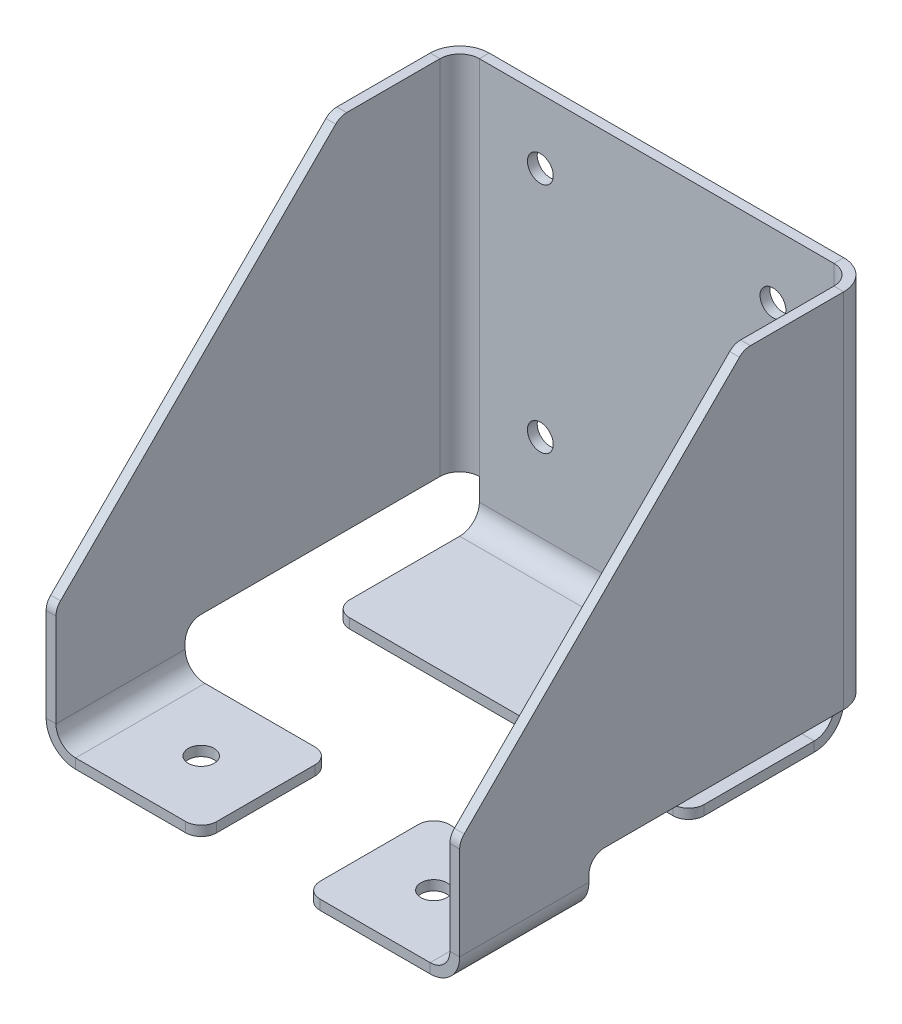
ISO-10303-21;
HEADER;
FILE_DESCRIPTION(('STEP AP214'),'2;1');
FILE_NAME('part.step','',(''),(''),'','','');
FILE_SCHEMA(('AUTOMOTIVE_DESIGN { 1 0 10303 214 1 1 1 1 }'));
ENDSEC;
DATA;
#1=APPLICATION_CONTEXT('core data for automotive mechanical design processes');
#2=APPLICATION_PROTOCOL_DEFINITION('international standard','automotive_design',2000,#1);
#3=PRODUCT_CONTEXT('',#1,'mechanical');
#4=PRODUCT('Part','Part','',(#3));
#5=PRODUCT_RELATED_PRODUCT_CATEGORY('part','',(#4));
#6=PRODUCT_DEFINITION_FORMATION('','',#4);
#7=PRODUCT_DEFINITION_CONTEXT('part definition',#1,'design');
#8=PRODUCT_DEFINITION('design','',#6,#7);
#9=PRODUCT_DEFINITION_SHAPE('','',#8);
#10=(LENGTH_UNIT() NAMED_UNIT(*) SI_UNIT(.MILLI.,.METRE.));
#11=(NAMED_UNIT(*) PLANE_ANGLE_UNIT() SI_UNIT($,.RADIAN.));
#12=(NAMED_UNIT(*) SI_UNIT($,.STERADIAN.) SOLID_ANGLE_UNIT());
#13=UNCERTAINTY_MEASURE_WITH_UNIT(LENGTH_MEASURE(1.E-05),#10,'distance_accuracy_value','');
#14=(GEOMETRIC_REPRESENTATION_CONTEXT(3) GLOBAL_UNCERTAINTY_ASSIGNED_CONTEXT((#13)) GLOBAL_UNIT_ASSIGNED_CONTEXT((#10,
#11,#12)) REPRESENTATION_CONTEXT('',''));
#15=CARTESIAN_POINT('',(0.,0.,0.));
#16=DIRECTION('',(0.,0.,1.));
#17=DIRECTION('',(1.,0.,0.));
#18=AXIS2_PLACEMENT_3D('',#15,#16,#17);
#19=CARTESIAN_POINT('',(-34.29262,0.,1.89738));
#20=DIRECTION('',(0.,-1.,0.));
#21=DIRECTION('',(0.,0.,-1.));
#22=AXIS2_PLACEMENT_3D('',#19,#20,#21);
#23=PLANE('',#22);
#24=DIRECTION('',(0.,0.,1.));
#25=VECTOR('',#24,1.);
#26=CARTESIAN_POINT('',(-38.10262,0.,0.));
#27=LINE('',#26,#25);
#28=CARTESIAN_POINT('',(-38.10262,0.,5.70738));
#29=VERTEX_POINT('',#28);
#30=CARTESIAN_POINT('',(-38.10262,0.,52.));
#31=VERTEX_POINT('',#30);
#32=EDGE_CURVE('E633',#29,#31,#27,.T.);
#33=ORIENTED_EDGE('',*,*,#32,.T.);
#34=DIRECTION('',(-1.,0.,0.));
#35=VECTOR('',#34,1.);
#36=CARTESIAN_POINT('',(-40.,0.,52.));
#37=LINE('',#36,#35);
#38=CARTESIAN_POINT('',(-40.,0.,52.));
#39=VERTEX_POINT('',#38);
#40=EDGE_CURVE('E669',#31,#39,#37,.T.);
#41=ORIENTED_EDGE('',*,*,#40,.T.);
#42=DIRECTION('',(0.,0.,1.));
#43=VECTOR('',#42,1.);
#44=CARTESIAN_POINT('',(-40.,0.,0.));
#45=LINE('',#44,#43);
#46=CARTESIAN_POINT('',(-40.,0.,5.70738));
#47=VERTEX_POINT('',#46);
#48=EDGE_CURVE('E610',#47,#39,#45,.T.);
#49=ORIENTED_EDGE('',*,*,#48,.F.);
#50=DIRECTION('',(1.,0.,0.));
#51=VECTOR('',#50,1.);
#52=CARTESIAN_POINT('',(-40.,0.,5.70738));
#53=LINE('',#52,#51);
#54=EDGE_CURVE('E658',#47,#29,#53,.T.);
#55=ORIENTED_EDGE('',*,*,#54,.T.);
#56=EDGE_LOOP('',(#33,#41,#49,#55));
#57=FACE_BOUND('',#56,.T.);
#58=ADVANCED_FACE('F76',(#57),#23,.T.);
#59=CARTESIAN_POINT('',(-40.,70.,0.));
#60=DIRECTION('',(1.,0.,0.));
#61=DIRECTION('',(0.,0.,-1.));
#62=AXIS2_PLACEMENT_3D('',#59,#60,#61);
#63=PLANE('',#62);
#64=DIRECTION('',(0.,-1.,0.));
#65=VECTOR('',#64,1.);
#66=CARTESIAN_POINT('',(-40.,70.,80.));
#67=LINE('',#66,#65);
#68=CARTESIAN_POINT('',(-40.,13.7573593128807,80.));
#69=VERTEX_POINT('',#68);
#70=CARTESIAN_POINT('',(-40.,-4.29262000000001,80.));
#71=VERTEX_POINT('',#70);
#72=EDGE_CURVE('E653',#69,#71,#67,.T.);
#73=ORIENTED_EDGE('',*,*,#72,.F.);
#74=CARTESIAN_POINT('',(-40.,13.7573593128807,77.));
#75=DIRECTION('',(1.,0.,0.));
#76=DIRECTION('',(0.,0.,-1.));
#77=AXIS2_PLACEMENT_3D('',#74,#75,#76);
#78=CIRCLE('',#77,3.);
#79=CARTESIAN_POINT('',(-40.,15.8786796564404,79.1213203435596));
#80=VERTEX_POINT('',#79);
#81=EDGE_CURVE('E756',#69,#80,#78,.F.);
#82=ORIENTED_EDGE('',*,*,#81,.T.);
#83=DIRECTION('',(0.,0.707106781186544,-0.707106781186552));
#84=VECTOR('',#83,1.);
#85=CARTESIAN_POINT('',(-40.,82.4999999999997,12.4999999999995));
#86=LINE('',#85,#84);
#87=CARTESIAN_POINT('',(-40.,69.1213203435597,25.8786796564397));
#88=VERTEX_POINT('',#87);
#89=EDGE_CURVE('E606',#80,#88,#86,.T.);
#90=ORIENTED_EDGE('',*,*,#89,.T.);
#91=CARTESIAN_POINT('',(-40.,67.,23.7573593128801));
#92=DIRECTION('',(1.,0.,0.));
#93=DIRECTION('',(0.,0.,-1.));
#94=AXIS2_PLACEMENT_3D('',#91,#92,#93);
#95=CIRCLE('',#94,3.);
#96=CARTESIAN_POINT('',(-40.,70.,23.7573593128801));
#97=VERTEX_POINT('',#96);
#98=EDGE_CURVE('E91',#88,#97,#95,.F.);
#99=ORIENTED_EDGE('',*,*,#98,.T.);
#100=DIRECTION('',(0.,0.,1.));
#101=VECTOR('',#100,1.);
#102=CARTESIAN_POINT('',(-40.,70.,0.));
#103=LINE('',#102,#101);
#104=CARTESIAN_POINT('',(-40.,70.,5.70738));
#105=VERTEX_POINT('',#104);
#106=EDGE_CURVE('E612',#105,#97,#103,.T.);
#107=ORIENTED_EDGE('',*,*,#106,.F.);
#108=DIRECTION('',(0.,-1.,0.));
#109=VECTOR('',#108,1.);
#110=CARTESIAN_POINT('',(-40.,70.,5.70738));
#111=LINE('',#110,#109);
#112=EDGE_CURVE('E630',#105,#47,#111,.T.);
#113=ORIENTED_EDGE('',*,*,#112,.T.);
#114=ORIENTED_EDGE('',*,*,#48,.T.);
#115=CARTESIAN_POINT('',(-40.,-3.,52.));
#116=DIRECTION('',(1.,0.,0.));
#117=DIRECTION('',(0.,0.,-1.));
#118=AXIS2_PLACEMENT_3D('',#115,#116,#117);
#119=CIRCLE('',#118,3.);
#120=CARTESIAN_POINT('',(-40.,-3.,55.));
#121=VERTEX_POINT('',#120);
#122=EDGE_CURVE('E84',#39,#121,#119,.T.);
#123=ORIENTED_EDGE('',*,*,#122,.T.);
#124=DIRECTION('',(0.,1.,0.));
#125=VECTOR('',#124,1.);
#126=CARTESIAN_POINT('',(-40.,-4.29262000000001,55.));
#127=LINE('',#126,#125);
#128=CARTESIAN_POINT('',(-40.,-4.29262000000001,55.));
#129=VERTEX_POINT('',#128);
#130=EDGE_CURVE('E598',#129,#121,#127,.T.);
#131=ORIENTED_EDGE('',*,*,#130,.F.);
#132=DIRECTION('',(0.,0.,-1.));
#133=VECTOR('',#132,1.);
#134=CARTESIAN_POINT('',(-40.,-4.29262000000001,55.));
#135=LINE('',#134,#133);
#136=EDGE_CURVE('E571',#129,#71,#135,.F.);
#137=ORIENTED_EDGE('',*,*,#136,.T.);
#138=EDGE_LOOP('',(#73,#82,#90,#99,#107,#113,#114,#123,#131,#137));
#139=FACE_BOUND('',#138,.T.);
#140=ADVANCED_FACE('F765',(#139),#63,.F.);
#141=CARTESIAN_POINT('',(-38.10262,70.,80.));
#142=DIRECTION('',(0.,0.,1.));
#143=DIRECTION('',(1.,0.,0.));
#144=AXIS2_PLACEMENT_3D('',#141,#142,#143);
#145=PLANE('',#144);
#146=DIRECTION('',(0.,-1.,0.));
#147=VECTOR('',#146,1.);
#148=CARTESIAN_POINT('',(-38.10262,70.,80.));
#149=LINE('',#148,#147);
#150=CARTESIAN_POINT('',(-38.10262,13.7573593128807,80.));
#151=VERTEX_POINT('',#150);
#152=CARTESIAN_POINT('',(-38.10262,-4.29262000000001,80.));
#153=VERTEX_POINT('',#152);
#154=EDGE_CURVE('E651',#151,#153,#149,.T.);
#155=ORIENTED_EDGE('',*,*,#154,.F.);
#156=DIRECTION('',(-1.,0.,0.));
#157=VECTOR('',#156,1.);
#158=CARTESIAN_POINT('',(-38.10262,13.7573593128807,80.));
#159=LINE('',#158,#157);
#160=EDGE_CURVE('E99',#151,#69,#159,.T.);
#161=ORIENTED_EDGE('',*,*,#160,.T.);
#162=ORIENTED_EDGE('',*,*,#72,.T.);
#163=DIRECTION('',(-1.,0.,0.));
#164=VECTOR('',#163,1.);
#165=CARTESIAN_POINT('',(-38.10262,-4.29262000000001,80.));
#166=LINE('',#165,#164);
#167=EDGE_CURVE('E589',#153,#71,#166,.T.);
#168=ORIENTED_EDGE('',*,*,#167,.F.);
#169=EDGE_LOOP('',(#155,#161,#162,#168));
#170=FACE_BOUND('',#169,.T.);
#171=ADVANCED_FACE('F803',(#170),#145,.T.);
#172=CARTESIAN_POINT('',(-38.10262,70.,0.));
#173=DIRECTION('',(1.,0.,0.));
#174=DIRECTION('',(0.,0.,-1.));
#175=AXIS2_PLACEMENT_3D('',#172,#173,#174);
#176=PLANE('',#175);
#177=DIRECTION('',(0.,0.707106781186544,-0.707106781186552));
#178=VECTOR('',#177,1.);
#179=CARTESIAN_POINT('',(-38.10262,82.4999999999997,12.4999999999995));
#180=LINE('',#179,#178);
#181=CARTESIAN_POINT('',(-38.10262,15.8786796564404,79.1213203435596));
#182=VERTEX_POINT('',#181);
#183=CARTESIAN_POINT('',(-38.10262,69.1213203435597,25.8786796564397));
#184=VERTEX_POINT('',#183);
#185=EDGE_CURVE('E607',#182,#184,#180,.T.);
#186=ORIENTED_EDGE('',*,*,#185,.F.);
#187=CARTESIAN_POINT('',(-38.10262,13.7573593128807,77.));
#188=DIRECTION('',(1.,0.,0.));
#189=DIRECTION('',(0.,0.,-1.));
#190=AXIS2_PLACEMENT_3D('',#187,#188,#189);
#191=CIRCLE('',#190,3.);
#192=EDGE_CURVE('E752',#182,#151,#191,.T.);
#193=ORIENTED_EDGE('',*,*,#192,.T.);
#194=ORIENTED_EDGE('',*,*,#154,.T.);
#195=DIRECTION('',(0.,0.,-1.));
#196=VECTOR('',#195,1.);
#197=CARTESIAN_POINT('',(-38.10262,-4.29262000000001,55.));
#198=LINE('',#197,#196);
#199=CARTESIAN_POINT('',(-38.10262,-4.29262000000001,55.));
#200=VERTEX_POINT('',#199);
#201=EDGE_CURVE('E584',#200,#153,#198,.F.);
#202=ORIENTED_EDGE('',*,*,#201,.F.);
#203=DIRECTION('',(0.,1.,0.));
#204=VECTOR('',#203,1.);
#205=CARTESIAN_POINT('',(-38.10262,-4.29262000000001,55.));
#206=LINE('',#205,#204);
#207=CARTESIAN_POINT('',(-38.10262,-3.,55.));
#208=VERTEX_POINT('',#207);
#209=EDGE_CURVE('E603',#200,#208,#206,.T.);
#210=ORIENTED_EDGE('',*,*,#209,.T.);
#211=CARTESIAN_POINT('',(-38.10262,-3.,52.));
#212=DIRECTION('',(1.,0.,0.));
#213=DIRECTION('',(0.,0.,-1.));
#214=AXIS2_PLACEMENT_3D('',#211,#212,#213);
#215=CIRCLE('',#214,3.);
#216=EDGE_CURVE('E13',#208,#31,#215,.F.);
#217=ORIENTED_EDGE('',*,*,#216,.T.);
#218=ORIENTED_EDGE('',*,*,#32,.F.);
#219=DIRECTION('',(0.,-1.,0.));
#220=VECTOR('',#219,1.);
#221=CARTESIAN_POINT('',(-38.10262,70.,5.70738));
#222=LINE('',#221,#220);
#223=CARTESIAN_POINT('',(-38.10262,70.,5.70738));
#224=VERTEX_POINT('',#223);
#225=EDGE_CURVE('E648',#224,#29,#222,.T.);
#226=ORIENTED_EDGE('',*,*,#225,.F.);
#227=DIRECTION('',(0.,0.,1.));
#228=VECTOR('',#227,1.);
#229=CARTESIAN_POINT('',(-38.10262,70.,0.));
#230=LINE('',#229,#228);
#231=CARTESIAN_POINT('',(-38.10262,70.,23.7573593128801));
#232=VERTEX_POINT('',#231);
#233=EDGE_CURVE('E614',#224,#232,#230,.T.);
#234=ORIENTED_EDGE('',*,*,#233,.T.);
#235=CARTESIAN_POINT('',(-38.10262,67.,23.7573593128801));
#236=DIRECTION('',(1.,0.,0.));
#237=DIRECTION('',(0.,0.,-1.));
#238=AXIS2_PLACEMENT_3D('',#235,#236,#237);
#239=CIRCLE('',#238,3.);
#240=EDGE_CURVE('E750',#232,#184,#239,.T.);
#241=ORIENTED_EDGE('',*,*,#240,.T.);
#242=EDGE_LOOP('',(#186,#193,#194,#202,#210,#217,#218,#226,#234,#241));
#243=FACE_BOUND('',#242,.T.);
#244=ADVANCED_FACE('F778',(#243),#176,.T.);
#245=CARTESIAN_POINT('',(-34.29262,70.,5.70738));
#246=DIRECTION('',(0.,1.,0.));
#247=DIRECTION('',(1.,0.,0.));
#248=AXIS2_PLACEMENT_3D('',#245,#246,#247);
#249=PLANE('',#248);
#250=ORIENTED_EDGE('',*,*,#106,.T.);
#251=DIRECTION('',(-1.,0.,0.));
#252=VECTOR('',#251,1.);
#253=CARTESIAN_POINT('',(-34.29262,70.,23.7573593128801));
#254=LINE('',#253,#252);
#255=EDGE_CURVE('E758',#97,#232,#254,.F.);
#256=ORIENTED_EDGE('',*,*,#255,.T.);
#257=ORIENTED_EDGE('',*,*,#233,.F.);
#258=DIRECTION('',(-1.,0.,0.));
#259=VECTOR('',#258,1.);
#260=CARTESIAN_POINT('',(-38.10262,70.,5.70738));
#261=LINE('',#260,#259);
#262=EDGE_CURVE('E660',#224,#105,#261,.T.);
#263=ORIENTED_EDGE('',*,*,#262,.T.);
#264=EDGE_LOOP('',(#250,#256,#257,#263));
#265=FACE_BOUND('',#264,.T.);
#266=ADVANCED_FACE('F791',(#265),#249,.T.);
#267=CARTESIAN_POINT('',(-34.29262,70.,0.));
#268=DIRECTION('',(0.,1.,0.));
#269=DIRECTION('',(0.,0.,1.));
#270=AXIS2_PLACEMENT_3D('',#267,#268,#269);
#271=PLANE('',#270);
#272=DIRECTION('',(0.,0.,1.));
#273=VECTOR('',#272,1.);
#274=CARTESIAN_POINT('',(-34.29262,70.,0.));
#275=LINE('',#274,#273);
#276=CARTESIAN_POINT('',(-34.29262,70.,0.));
#277=VERTEX_POINT('',#276);
#278=CARTESIAN_POINT('',(-34.29262,70.,1.89738));
#279=VERTEX_POINT('',#278);
#280=EDGE_CURVE('E662',#277,#279,#275,.T.);
#281=ORIENTED_EDGE('',*,*,#280,.F.);
#282=CARTESIAN_POINT('',(-34.29262,70.,5.70738));
#283=DIRECTION('',(0.,-1.,0.));
#284=DIRECTION('',(0.,0.,-1.));
#285=AXIS2_PLACEMENT_3D('',#282,#283,#284);
#286=CIRCLE('',#285,5.70738);
#287=EDGE_CURVE('E627',#277,#105,#286,.F.);
#288=ORIENTED_EDGE('',*,*,#287,.T.);
#289=ORIENTED_EDGE('',*,*,#262,.F.);
#290=CARTESIAN_POINT('',(-34.29262,70.,5.70738));
#291=DIRECTION('',(0.,1.,0.));
#292=DIRECTION('',(1.,0.,0.));
#293=AXIS2_PLACEMENT_3D('',#290,#291,#292);
#294=CIRCLE('',#293,3.81);
#295=EDGE_CURVE('E618',#279,#224,#294,.T.);
#296=ORIENTED_EDGE('',*,*,#295,.F.);
#297=EDGE_LOOP('',(#281,#288,#289,#296));
#298=FACE_BOUND('',#297,.T.);
#299=ADVANCED_FACE('F872',(#298),#271,.T.);
#300=CARTESIAN_POINT('',(-38.10262,70.,5.70738));
#301=DIRECTION('',(0.,1.,0.));
#302=DIRECTION('',(0.,0.,1.));
#303=AXIS2_PLACEMENT_3D('',#300,#301,#302);
#304=PLANE('',#303);
#305=DIRECTION('',(-1.,0.,0.));
#306=VECTOR('',#305,1.);
#307=CARTESIAN_POINT('',(0.,70.,0.));
#308=LINE('',#307,#306);
#309=CARTESIAN_POINT('',(34.29262,70.,0.));
#310=VERTEX_POINT('',#309);
#311=EDGE_CURVE('E624',#310,#277,#308,.T.);
#312=ORIENTED_EDGE('',*,*,#311,.T.);
#313=ORIENTED_EDGE('',*,*,#280,.T.);
#314=DIRECTION('',(1.,0.,0.));
#315=VECTOR('',#314,1.);
#316=CARTESIAN_POINT('',(0.,70.,1.89738));
#317=LINE('',#316,#315);
#318=CARTESIAN_POINT('',(34.29262,70.,1.89738));
#319=VERTEX_POINT('',#318);
#320=EDGE_CURVE('E621',#319,#279,#317,.F.);
#321=ORIENTED_EDGE('',*,*,#320,.F.);
#322=DIRECTION('',(0.,0.,1.));
#323=VECTOR('',#322,1.);
#324=CARTESIAN_POINT('',(34.29262,70.,0.));
#325=LINE('',#324,#323);
#326=EDGE_CURVE('E517',#310,#319,#325,.T.);
#327=ORIENTED_EDGE('',*,*,#326,.F.);
#328=EDGE_LOOP('',(#312,#313,#321,#327));
#329=FACE_BOUND('',#328,.T.);
#330=ADVANCED_FACE('F869',(#329),#304,.T.);
#331=CARTESIAN_POINT('',(-40.,0.,5.70738));
#332=DIRECTION('',(0.,-1.,0.));
#333=DIRECTION('',(0.,0.,-1.));
#334=AXIS2_PLACEMENT_3D('',#331,#332,#333);
#335=PLANE('',#334);
#336=ORIENTED_EDGE('',*,*,#54,.F.);
#337=CARTESIAN_POINT('',(-34.29262,0.,5.70738));
#338=DIRECTION('',(0.,-1.,0.));
#339=DIRECTION('',(0.,0.,-1.));
#340=AXIS2_PLACEMENT_3D('',#337,#338,#339);
#341=CIRCLE('',#340,5.70738);
#342=CARTESIAN_POINT('',(-34.29262,0.,0.));
#343=VERTEX_POINT('',#342);
#344=EDGE_CURVE('E615',#343,#47,#341,.F.);
#345=ORIENTED_EDGE('',*,*,#344,.F.);
#346=DIRECTION('',(0.,0.,-1.));
#347=VECTOR('',#346,1.);
#348=CARTESIAN_POINT('',(-34.29262,0.,1.89738));
#349=LINE('',#348,#347);
#350=CARTESIAN_POINT('',(-34.29262,0.,1.89738));
#351=VERTEX_POINT('',#350);
#352=EDGE_CURVE('E655',#351,#343,#349,.T.);
#353=ORIENTED_EDGE('',*,*,#352,.F.);
#354=CARTESIAN_POINT('',(-34.29262,0.,5.70738));
#355=DIRECTION('',(0.,1.,0.));
#356=DIRECTION('',(1.,0.,0.));
#357=AXIS2_PLACEMENT_3D('',#354,#355,#356);
#358=CIRCLE('',#357,3.81);
#359=EDGE_CURVE('E636',#351,#29,#358,.T.);
#360=ORIENTED_EDGE('',*,*,#359,.T.);
#361=EDGE_LOOP('',(#336,#345,#353,#360));
#362=FACE_BOUND('',#361,.T.);
#363=ADVANCED_FACE('F866',(#362),#335,.T.);
#364=CARTESIAN_POINT('',(-34.29262,70.,5.70738));
#365=DIRECTION('',(0.,-1.,0.));
#366=DIRECTION('',(0.,0.,-1.));
#367=AXIS2_PLACEMENT_3D('',#364,#365,#366);
#368=CYLINDRICAL_SURFACE('',#367,3.81);
#369=ORIENTED_EDGE('',*,*,#359,.F.);
#370=DIRECTION('',(0.,-1.,0.));
#371=VECTOR('',#370,1.);
#372=CARTESIAN_POINT('',(-34.29262,70.,1.89738));
#373=LINE('',#372,#371);
#374=EDGE_CURVE('E645',#279,#351,#373,.T.);
#375=ORIENTED_EDGE('',*,*,#374,.F.);
#376=ORIENTED_EDGE('',*,*,#295,.T.);
#377=ORIENTED_EDGE('',*,*,#225,.T.);
#378=EDGE_LOOP('',(#369,#375,#376,#377));
#379=FACE_BOUND('',#378,.T.);
#380=ADVANCED_FACE('F786',(#379),#368,.F.);
#381=CARTESIAN_POINT('',(0.,70.,1.89738));
#382=DIRECTION('',(0.,0.,1.));
#383=DIRECTION('',(1.,0.,0.));
#384=AXIS2_PLACEMENT_3D('',#381,#382,#383);
#385=PLANE('',#384);
#386=CARTESIAN_POINT('',(-22.5,57.5,1.89738));
#387=DIRECTION('',(0.,0.,1.));
#388=DIRECTION('',(1.,0.,0.));
#389=AXIS2_PLACEMENT_3D('',#386,#387,#388);
#390=CIRCLE('',#389,2.49999999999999);
#391=CARTESIAN_POINT('',(-20.,57.5,1.89738));
#392=VERTEX_POINT('',#391);
#393=EDGE_CURVE('E1269',#392,#392,#390,.T.);
#394=ORIENTED_EDGE('',*,*,#393,.F.);
#395=EDGE_LOOP('',(#394));
#396=FACE_BOUND('',#395,.T.);
#397=CARTESIAN_POINT('',(22.5,57.5,1.89738000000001));
#398=DIRECTION('',(0.,0.,1.));
#399=DIRECTION('',(1.,0.,0.));
#400=AXIS2_PLACEMENT_3D('',#397,#398,#399);
#401=CIRCLE('',#400,2.49999999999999);
#402=CARTESIAN_POINT('',(25.,57.5,1.89738000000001));
#403=VERTEX_POINT('',#402);
#404=EDGE_CURVE('E1275',#403,#403,#401,.T.);
#405=ORIENTED_EDGE('',*,*,#404,.F.);
#406=EDGE_LOOP('',(#405));
#407=FACE_BOUND('',#406,.T.);
#408=CARTESIAN_POINT('',(-22.5,12.5,1.89738));
#409=DIRECTION('',(0.,0.,1.));
#410=DIRECTION('',(1.,0.,0.));
#411=AXIS2_PLACEMENT_3D('',#408,#409,#410);
#412=CIRCLE('',#411,2.49999999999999);
#413=CARTESIAN_POINT('',(-20.,12.5,1.89738));
#414=VERTEX_POINT('',#413);
#415=EDGE_CURVE('E1281',#414,#414,#412,.T.);
#416=ORIENTED_EDGE('',*,*,#415,.F.);
#417=EDGE_LOOP('',(#416));
#418=FACE_BOUND('',#417,.T.);
#419=CARTESIAN_POINT('',(22.5,12.5,1.89738000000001));
#420=DIRECTION('',(0.,0.,1.));
#421=DIRECTION('',(1.,0.,0.));
#422=AXIS2_PLACEMENT_3D('',#419,#420,#421);
#423=CIRCLE('',#422,2.49999999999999);
#424=CARTESIAN_POINT('',(25.,12.5,1.89738000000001));
#425=VERTEX_POINT('',#424);
#426=EDGE_CURVE('E401',#425,#425,#423,.T.);
#427=ORIENTED_EDGE('',*,*,#426,.F.);
#428=EDGE_LOOP('',(#427));
#429=FACE_BOUND('',#428,.T.);
#430=ORIENTED_EDGE('',*,*,#374,.T.);
#431=DIRECTION('',(0.,1.,0.));
#432=VECTOR('',#431,1.);
#433=CARTESIAN_POINT('',(-34.29262,-4.29262000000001,1.89738));
#434=LINE('',#433,#432);
#435=CARTESIAN_POINT('',(-34.29262,-4.29262000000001,1.89738));
#436=VERTEX_POINT('',#435);
#437=EDGE_CURVE('E592',#436,#351,#434,.T.);
#438=ORIENTED_EDGE('',*,*,#437,.F.);
#439=DIRECTION('',(1.,0.,0.));
#440=VECTOR('',#439,1.);
#441=CARTESIAN_POINT('',(0.,-4.29262000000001,1.89738));
#442=LINE('',#441,#440);
#443=CARTESIAN_POINT('',(34.29262,-4.29262000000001,1.89738));
#444=VERTEX_POINT('',#443);
#445=EDGE_CURVE('E522',#444,#436,#442,.F.);
#446=ORIENTED_EDGE('',*,*,#445,.F.);
#447=DIRECTION('',(0.,1.,0.));
#448=VECTOR('',#447,1.);
#449=CARTESIAN_POINT('',(34.29262,-4.29262000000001,1.89738));
#450=LINE('',#449,#448);
#451=CARTESIAN_POINT('',(34.29262,0.,1.89738));
#452=VERTEX_POINT('',#451);
#453=EDGE_CURVE('E454',#444,#452,#450,.T.);
#454=ORIENTED_EDGE('',*,*,#453,.T.);
#455=DIRECTION('',(0.,-1.,0.));
#456=VECTOR('',#455,1.);
#457=CARTESIAN_POINT('',(34.29262,70.,1.89738));
#458=LINE('',#457,#456);
#459=EDGE_CURVE('E498',#319,#452,#458,.T.);
#460=ORIENTED_EDGE('',*,*,#459,.F.);
#461=ORIENTED_EDGE('',*,*,#320,.T.);
#462=EDGE_LOOP('',(#430,#438,#446,#454,#460,#461));
#463=FACE_BOUND('',#462,.T.);
#464=ADVANCED_FACE('F1055',(#396,#407,#418,#429,#463),#385,.T.);
#465=CARTESIAN_POINT('',(0.,70.,0.));
#466=DIRECTION('',(0.,0.,1.));
#467=DIRECTION('',(1.,0.,0.));
#468=AXIS2_PLACEMENT_3D('',#465,#466,#467);
#469=PLANE('',#468);
#470=CARTESIAN_POINT('',(-22.5,57.5,0.));
#471=DIRECTION('',(0.,0.,1.));
#472=DIRECTION('',(1.,0.,0.));
#473=AXIS2_PLACEMENT_3D('',#470,#471,#472);
#474=CIRCLE('',#473,2.49999999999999);
#475=CARTESIAN_POINT('',(-20.,57.5,0.));
#476=VERTEX_POINT('',#475);
#477=EDGE_CURVE('E1272',#476,#476,#474,.T.);
#478=ORIENTED_EDGE('',*,*,#477,.T.);
#479=EDGE_LOOP('',(#478));
#480=FACE_BOUND('',#479,.T.);
#481=CARTESIAN_POINT('',(22.5,57.5,0.));
#482=DIRECTION('',(0.,0.,1.));
#483=DIRECTION('',(1.,0.,0.));
#484=AXIS2_PLACEMENT_3D('',#481,#482,#483);
#485=CIRCLE('',#484,2.49999999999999);
#486=CARTESIAN_POINT('',(25.,57.5,0.));
#487=VERTEX_POINT('',#486);
#488=EDGE_CURVE('E1278',#487,#487,#485,.T.);
#489=ORIENTED_EDGE('',*,*,#488,.T.);
#490=EDGE_LOOP('',(#489));
#491=FACE_BOUND('',#490,.T.);
#492=CARTESIAN_POINT('',(-22.5,12.5,0.));
#493=DIRECTION('',(0.,0.,1.));
#494=DIRECTION('',(1.,0.,0.));
#495=AXIS2_PLACEMENT_3D('',#492,#493,#494);
#496=CIRCLE('',#495,2.49999999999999);
#497=CARTESIAN_POINT('',(-20.,12.5,0.));
#498=VERTEX_POINT('',#497);
#499=EDGE_CURVE('E1284',#498,#498,#496,.T.);
#500=ORIENTED_EDGE('',*,*,#499,.T.);
#501=EDGE_LOOP('',(#500));
#502=FACE_BOUND('',#501,.T.);
#503=CARTESIAN_POINT('',(22.5,12.5,0.));
#504=DIRECTION('',(0.,0.,1.));
#505=DIRECTION('',(1.,0.,0.));
#506=AXIS2_PLACEMENT_3D('',#503,#504,#505);
#507=CIRCLE('',#506,2.49999999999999);
#508=CARTESIAN_POINT('',(25.,12.5,0.));
#509=VERTEX_POINT('',#508);
#510=EDGE_CURVE('E397',#509,#509,#507,.T.);
#511=ORIENTED_EDGE('',*,*,#510,.T.);
#512=EDGE_LOOP('',(#511));
#513=FACE_BOUND('',#512,.T.);
#514=ORIENTED_EDGE('',*,*,#311,.F.);
#515=DIRECTION('',(0.,-1.,0.));
#516=VECTOR('',#515,1.);
#517=CARTESIAN_POINT('',(34.29262,70.,0.));
#518=LINE('',#517,#516);
#519=CARTESIAN_POINT('',(34.29262,0.,0.));
#520=VERTEX_POINT('',#519);
#521=EDGE_CURVE('E495',#310,#520,#518,.T.);
#522=ORIENTED_EDGE('',*,*,#521,.T.);
#523=DIRECTION('',(0.,1.,0.));
#524=VECTOR('',#523,1.);
#525=CARTESIAN_POINT('',(34.29262,-4.29262000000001,0.));
#526=LINE('',#525,#524);
#527=CARTESIAN_POINT('',(34.29262,-4.29262000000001,0.));
#528=VERTEX_POINT('',#527);
#529=EDGE_CURVE('E457',#528,#520,#526,.T.);
#530=ORIENTED_EDGE('',*,*,#529,.F.);
#531=DIRECTION('',(1.,0.,0.));
#532=VECTOR('',#531,1.);
#533=CARTESIAN_POINT('',(0.,-4.29262000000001,0.));
#534=LINE('',#533,#532);
#535=CARTESIAN_POINT('',(-34.29262,-4.29262000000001,0.));
#536=VERTEX_POINT('',#535);
#537=EDGE_CURVE('E388',#528,#536,#534,.F.);
#538=ORIENTED_EDGE('',*,*,#537,.T.);
#539=DIRECTION('',(0.,1.,0.));
#540=VECTOR('',#539,1.);
#541=CARTESIAN_POINT('',(-34.29262,-4.29262000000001,0.));
#542=LINE('',#541,#540);
#543=EDGE_CURVE('E595',#536,#343,#542,.T.);
#544=ORIENTED_EDGE('',*,*,#543,.T.);
#545=DIRECTION('',(0.,-1.,0.));
#546=VECTOR('',#545,1.);
#547=CARTESIAN_POINT('',(-34.29262,70.,0.));
#548=LINE('',#547,#546);
#549=EDGE_CURVE('E643',#277,#343,#548,.T.);
#550=ORIENTED_EDGE('',*,*,#549,.F.);
#551=EDGE_LOOP('',(#514,#522,#530,#538,#544,#550));
#552=FACE_BOUND('',#551,.T.);
#553=ADVANCED_FACE('F1065',(#480,#491,#502,#513,#552),#469,.F.);
#554=CARTESIAN_POINT('',(-34.29262,70.,5.70738));
#555=DIRECTION('',(0.,-1.,0.));
#556=DIRECTION('',(0.,0.,-1.));
#557=AXIS2_PLACEMENT_3D('',#554,#555,#556);
#558=CYLINDRICAL_SURFACE('',#557,5.70738);
#559=ORIENTED_EDGE('',*,*,#344,.T.);
#560=ORIENTED_EDGE('',*,*,#112,.F.);
#561=ORIENTED_EDGE('',*,*,#287,.F.);
#562=ORIENTED_EDGE('',*,*,#549,.T.);
#563=EDGE_LOOP('',(#559,#560,#561,#562));
#564=FACE_BOUND('',#563,.T.);
#565=ADVANCED_FACE('F1107',(#564),#558,.T.);
#566=CARTESIAN_POINT('',(-40.,82.4999999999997,12.4999999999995));
#567=DIRECTION('',(0.,-0.707106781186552,-0.707106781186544));
#568=DIRECTION('',(0.,0.707106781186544,-0.707106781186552));
#569=AXIS2_PLACEMENT_3D('',#566,#567,#568);
#570=PLANE('',#569);
#571=ORIENTED_EDGE('',*,*,#89,.F.);
#572=DIRECTION('',(1.,0.,0.));
#573=VECTOR('',#572,1.);
#574=CARTESIAN_POINT('',(-40.,15.8786796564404,79.1213203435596));
#575=LINE('',#574,#573);
#576=EDGE_CURVE('E747',#80,#182,#575,.T.);
#577=ORIENTED_EDGE('',*,*,#576,.T.);
#578=ORIENTED_EDGE('',*,*,#185,.T.);
#579=DIRECTION('',(1.,0.,0.));
#580=VECTOR('',#579,1.);
#581=CARTESIAN_POINT('',(-40.,69.1213203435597,25.8786796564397));
#582=LINE('',#581,#580);
#583=EDGE_CURVE('E745',#184,#88,#582,.F.);
#584=ORIENTED_EDGE('',*,*,#583,.T.);
#585=EDGE_LOOP('',(#571,#577,#578,#584));
#586=FACE_BOUND('',#585,.T.);
#587=ADVANCED_FACE('F797',(#586),#570,.F.);
#588=CARTESIAN_POINT('',(-38.10262,-4.29262000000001,55.));
#589=DIRECTION('',(0.,0.,-1.));
#590=DIRECTION('',(-1.,0.,0.));
#591=AXIS2_PLACEMENT_3D('',#588,#589,#590);
#592=PLANE('',#591);
#593=ORIENTED_EDGE('',*,*,#130,.T.);
#594=DIRECTION('',(-1.,0.,0.));
#595=VECTOR('',#594,1.);
#596=CARTESIAN_POINT('',(-38.10262,-3.,55.));
#597=LINE('',#596,#595);
#598=EDGE_CURVE('E672',#121,#208,#597,.F.);
#599=ORIENTED_EDGE('',*,*,#598,.T.);
#600=ORIENTED_EDGE('',*,*,#209,.F.);
#601=DIRECTION('',(-1.,0.,0.));
#602=VECTOR('',#601,1.);
#603=CARTESIAN_POINT('',(-38.10262,-4.29262000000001,55.));
#604=LINE('',#603,#602);
#605=EDGE_CURVE('E578',#200,#129,#604,.T.);
#606=ORIENTED_EDGE('',*,*,#605,.T.);
#607=EDGE_LOOP('',(#593,#599,#600,#606));
#608=FACE_BOUND('',#607,.T.);
#609=ADVANCED_FACE('F771',(#608),#592,.T.);
#610=CARTESIAN_POINT('',(-34.29262,-4.29262000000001,1.89738));
#611=DIRECTION('',(1.,0.,0.));
#612=DIRECTION('',(0.,0.,-1.));
#613=AXIS2_PLACEMENT_3D('',#610,#611,#612);
#614=PLANE('',#613);
#615=ORIENTED_EDGE('',*,*,#543,.F.);
#616=DIRECTION('',(0.,0.,-1.));
#617=VECTOR('',#616,1.);
#618=CARTESIAN_POINT('',(-34.29262,-4.29262000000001,1.89738));
#619=LINE('',#618,#617);
#620=EDGE_CURVE('E537',#436,#536,#619,.T.);
#621=ORIENTED_EDGE('',*,*,#620,.F.);
#622=ORIENTED_EDGE('',*,*,#437,.T.);
#623=ORIENTED_EDGE('',*,*,#352,.T.);
#624=EDGE_LOOP('',(#615,#621,#622,#623));
#625=FACE_BOUND('',#624,.T.);
#626=ADVANCED_FACE('F1061',(#625),#614,.F.);
#627=CARTESIAN_POINT('',(-34.29262,-4.29262000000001,80.));
#628=DIRECTION('',(0.,0.,1.));
#629=DIRECTION('',(1.,0.,0.));
#630=AXIS2_PLACEMENT_3D('',#627,#628,#629);
#631=PLANE('',#630);
#632=DIRECTION('',(0.,1.,0.));
#633=VECTOR('',#632,1.);
#634=CARTESIAN_POINT('',(-34.29262,-10.,80.));
#635=LINE('',#634,#633);
#636=CARTESIAN_POINT('',(-34.29262,-8.10262000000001,80.));
#637=VERTEX_POINT('',#636);
#638=CARTESIAN_POINT('',(-34.29262,-10.,80.));
#639=VERTEX_POINT('',#638);
#640=EDGE_CURVE('E543',#637,#639,#635,.F.);
#641=ORIENTED_EDGE('',*,*,#640,.F.);
#642=CARTESIAN_POINT('',(-34.29262,-4.29262000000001,80.));
#643=DIRECTION('',(0.,0.,-1.));
#644=DIRECTION('',(-1.,0.,0.));
#645=AXIS2_PLACEMENT_3D('',#642,#643,#644);
#646=CIRCLE('',#645,3.81);
#647=EDGE_CURVE('E581',#153,#637,#646,.F.);
#648=ORIENTED_EDGE('',*,*,#647,.F.);
#649=ORIENTED_EDGE('',*,*,#167,.T.);
#650=CARTESIAN_POINT('',(-34.29262,-4.29262000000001,80.));
#651=DIRECTION('',(0.,0.,-1.));
#652=DIRECTION('',(-1.,0.,0.));
#653=AXIS2_PLACEMENT_3D('',#650,#651,#652);
#654=CIRCLE('',#653,5.70738);
#655=EDGE_CURVE('E574',#71,#639,#654,.F.);
#656=ORIENTED_EDGE('',*,*,#655,.T.);
#657=EDGE_LOOP('',(#641,#648,#649,#656));
#658=FACE_BOUND('',#657,.T.);
#659=ADVANCED_FACE('F808',(#658),#631,.T.);
#660=CARTESIAN_POINT('',(-34.29262,-4.29262000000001,55.));
#661=DIRECTION('',(0.,0.,1.));
#662=DIRECTION('',(1.,0.,0.));
#663=AXIS2_PLACEMENT_3D('',#660,#661,#662);
#664=PLANE('',#663);
#665=CARTESIAN_POINT('',(-34.29262,-4.29262000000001,55.));
#666=DIRECTION('',(0.,0.,-1.));
#667=DIRECTION('',(-1.,0.,0.));
#668=AXIS2_PLACEMENT_3D('',#665,#666,#667);
#669=CIRCLE('',#668,3.81);
#670=CARTESIAN_POINT('',(-34.29262,-8.10262000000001,55.));
#671=VERTEX_POINT('',#670);
#672=EDGE_CURVE('E546',#671,#200,#669,.T.);
#673=ORIENTED_EDGE('',*,*,#672,.F.);
#674=DIRECTION('',(0.,1.,0.));
#675=VECTOR('',#674,1.);
#676=CARTESIAN_POINT('',(-34.29262,-8.10262000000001,55.));
#677=LINE('',#676,#675);
#678=CARTESIAN_POINT('',(-34.29262,-10.,55.));
#679=VERTEX_POINT('',#678);
#680=EDGE_CURVE('E564',#671,#679,#677,.F.);
#681=ORIENTED_EDGE('',*,*,#680,.T.);
#682=CARTESIAN_POINT('',(-34.29262,-4.29262000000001,55.));
#683=DIRECTION('',(0.,0.,-1.));
#684=DIRECTION('',(-1.,0.,0.));
#685=AXIS2_PLACEMENT_3D('',#682,#683,#684);
#686=CIRCLE('',#685,5.70738);
#687=EDGE_CURVE('E575',#679,#129,#686,.T.);
#688=ORIENTED_EDGE('',*,*,#687,.T.);
#689=ORIENTED_EDGE('',*,*,#605,.F.);
#690=EDGE_LOOP('',(#673,#681,#688,#689));
#691=FACE_BOUND('',#690,.T.);
#692=ADVANCED_FACE('F813',(#691),#664,.F.);
#693=CARTESIAN_POINT('',(-34.29262,-4.29262000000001,55.));
#694=DIRECTION('',(0.,0.,-1.));
#695=DIRECTION('',(0.,-1.,0.));
#696=AXIS2_PLACEMENT_3D('',#693,#694,#695);
#697=CYLINDRICAL_SURFACE('',#696,5.70738);
#698=ORIENTED_EDGE('',*,*,#136,.F.);
#699=ORIENTED_EDGE('',*,*,#687,.F.);
#700=DIRECTION('',(0.,0.,-1.));
#701=VECTOR('',#700,1.);
#702=CARTESIAN_POINT('',(-34.29262,-10.,80.));
#703=LINE('',#702,#701);
#704=EDGE_CURVE('E561',#679,#639,#703,.F.);
#705=ORIENTED_EDGE('',*,*,#704,.T.);
#706=ORIENTED_EDGE('',*,*,#655,.F.);
#707=EDGE_LOOP('',(#698,#699,#705,#706));
#708=FACE_BOUND('',#707,.T.);
#709=ADVANCED_FACE('F810',(#708),#697,.T.);
#710=CARTESIAN_POINT('',(-34.29262,-4.29262000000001,55.));
#711=DIRECTION('',(0.,0.,-1.));
#712=DIRECTION('',(0.,-1.,0.));
#713=AXIS2_PLACEMENT_3D('',#710,#711,#712);
#714=CYLINDRICAL_SURFACE('',#713,3.81);
#715=ORIENTED_EDGE('',*,*,#201,.T.);
#716=ORIENTED_EDGE('',*,*,#647,.T.);
#717=DIRECTION('',(0.,0.,-1.));
#718=VECTOR('',#717,1.);
#719=CARTESIAN_POINT('',(-34.29262,-8.10262000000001,80.));
#720=LINE('',#719,#718);
#721=EDGE_CURVE('E567',#637,#671,#720,.T.);
#722=ORIENTED_EDGE('',*,*,#721,.T.);
#723=ORIENTED_EDGE('',*,*,#672,.T.);
#724=EDGE_LOOP('',(#715,#716,#722,#723));
#725=FACE_BOUND('',#724,.T.);
#726=ADVANCED_FACE('F842',(#725),#714,.F.);
#727=CARTESIAN_POINT('',(-10.,-10.0000000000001,55.));
#728=DIRECTION('',(0.,0.,1.));
#729=DIRECTION('',(0.,-1.,0.));
#730=AXIS2_PLACEMENT_3D('',#727,#728,#729);
#731=PLANE('',#730);
#732=DIRECTION('',(-1.,0.,0.));
#733=VECTOR('',#732,1.);
#734=CARTESIAN_POINT('',(-9.99999999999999,-8.1026200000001,55.));
#735=LINE('',#734,#733);
#736=CARTESIAN_POINT('',(-13.,-8.10262000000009,55.));
#737=VERTEX_POINT('',#736);
#738=EDGE_CURVE('E558',#671,#737,#735,.F.);
#739=ORIENTED_EDGE('',*,*,#738,.T.);
#740=DIRECTION('',(0.,1.,0.));
#741=VECTOR('',#740,1.);
#742=CARTESIAN_POINT('',(-13.,-10.0000000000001,55.));
#743=LINE('',#742,#741);
#744=CARTESIAN_POINT('',(-13.,-10.0000000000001,55.));
#745=VERTEX_POINT('',#744);
#746=EDGE_CURVE('E708',#737,#745,#743,.F.);
#747=ORIENTED_EDGE('',*,*,#746,.T.);
#748=DIRECTION('',(1.,0.,0.));
#749=VECTOR('',#748,1.);
#750=CARTESIAN_POINT('',(0.,-10.0000000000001,55.));
#751=LINE('',#750,#749);
#752=EDGE_CURVE('E550',#679,#745,#751,.T.);
#753=ORIENTED_EDGE('',*,*,#752,.F.);
#754=ORIENTED_EDGE('',*,*,#680,.F.);
#755=EDGE_LOOP('',(#739,#747,#753,#754));
#756=FACE_BOUND('',#755,.T.);
#757=ADVANCED_FACE('F823',(#756),#731,.F.);
#758=CARTESIAN_POINT('',(-38.10262,-10.,80.));
#759=DIRECTION('',(0.,0.,-1.));
#760=DIRECTION('',(-1.,0.,0.));
#761=AXIS2_PLACEMENT_3D('',#758,#759,#760);
#762=PLANE('',#761);
#763=DIRECTION('',(-1.,0.,0.));
#764=VECTOR('',#763,1.);
#765=CARTESIAN_POINT('',(0.,-10.0000000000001,80.));
#766=LINE('',#765,#764);
#767=CARTESIAN_POINT('',(-13.,-10.0000000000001,80.));
#768=VERTEX_POINT('',#767);
#769=EDGE_CURVE('E544',#768,#639,#766,.T.);
#770=ORIENTED_EDGE('',*,*,#769,.F.);
#771=DIRECTION('',(0.,1.,0.));
#772=VECTOR('',#771,1.);
#773=CARTESIAN_POINT('',(-13.,-10.0000000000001,80.));
#774=LINE('',#773,#772);
#775=CARTESIAN_POINT('',(-13.,-8.10262000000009,80.));
#776=VERTEX_POINT('',#775);
#777=EDGE_CURVE('E692',#768,#776,#774,.T.);
#778=ORIENTED_EDGE('',*,*,#777,.T.);
#779=DIRECTION('',(1.,0.,0.));
#780=VECTOR('',#779,1.);
#781=CARTESIAN_POINT('',(-38.10262,-8.10262,80.));
#782=LINE('',#781,#780);
#783=EDGE_CURVE('E553',#776,#637,#782,.F.);
#784=ORIENTED_EDGE('',*,*,#783,.T.);
#785=ORIENTED_EDGE('',*,*,#640,.T.);
#786=EDGE_LOOP('',(#770,#778,#784,#785));
#787=FACE_BOUND('',#786,.T.);
#788=ADVANCED_FACE('F838',(#787),#762,.F.);
#789=CARTESIAN_POINT('',(0.,-10.0000000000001,0.));
#790=DIRECTION('',(0.,1.,0.));
#791=DIRECTION('',(-1.,0.,0.));
#792=AXIS2_PLACEMENT_3D('',#789,#790,#791);
#793=PLANE('',#792);
#794=CARTESIAN_POINT('',(-22.5,-10.0000000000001,67.5));
#795=DIRECTION('',(0.,1.,0.));
#796=DIRECTION('',(-1.,0.,0.));
#797=AXIS2_PLACEMENT_3D('',#794,#795,#796);
#798=CIRCLE('',#797,2.49999999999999);
#799=CARTESIAN_POINT('',(-25.,-10.,67.5));
#800=VERTEX_POINT('',#799);
#801=EDGE_CURVE('E1257',#800,#800,#798,.T.);
#802=ORIENTED_EDGE('',*,*,#801,.T.);
#803=EDGE_LOOP('',(#802));
#804=FACE_BOUND('',#803,.T.);
#805=DIRECTION('',(0.,0.,1.));
#806=VECTOR('',#805,1.);
#807=CARTESIAN_POINT('',(-10.,-10.0000000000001,0.));
#808=LINE('',#807,#806);
#809=CARTESIAN_POINT('',(-10.,-10.0000000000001,58.));
#810=VERTEX_POINT('',#809);
#811=CARTESIAN_POINT('',(-10.,-10.0000000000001,77.));
#812=VERTEX_POINT('',#811);
#813=EDGE_CURVE('E547',#810,#812,#808,.T.);
#814=ORIENTED_EDGE('',*,*,#813,.T.);
#815=CARTESIAN_POINT('',(-13.,-10.0000000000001,77.));
#816=DIRECTION('',(0.,1.,0.));
#817=DIRECTION('',(-1.,0.,0.));
#818=AXIS2_PLACEMENT_3D('',#815,#816,#817);
#819=CIRCLE('',#818,3.);
#820=EDGE_CURVE('E706',#812,#768,#819,.F.);
#821=ORIENTED_EDGE('',*,*,#820,.T.);
#822=ORIENTED_EDGE('',*,*,#769,.T.);
#823=ORIENTED_EDGE('',*,*,#704,.F.);
#824=ORIENTED_EDGE('',*,*,#752,.T.);
#825=CARTESIAN_POINT('',(-13.,-10.0000000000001,58.));
#826=DIRECTION('',(0.,1.,0.));
#827=DIRECTION('',(-1.,0.,0.));
#828=AXIS2_PLACEMENT_3D('',#825,#826,#827);
#829=CIRCLE('',#828,3.);
#830=EDGE_CURVE('E704',#745,#810,#829,.F.);
#831=ORIENTED_EDGE('',*,*,#830,.T.);
#832=EDGE_LOOP('',(#814,#821,#822,#823,#824,#831));
#833=FACE_BOUND('',#832,.T.);
#834=ADVANCED_FACE('F820',(#804,#833),#793,.F.);
#835=CARTESIAN_POINT('',(0.,-8.10262000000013,0.));
#836=DIRECTION('',(0.,1.,0.));
#837=DIRECTION('',(-1.,0.,0.));
#838=AXIS2_PLACEMENT_3D('',#835,#836,#837);
#839=PLANE('',#838);
#840=CARTESIAN_POINT('',(-22.5,-8.1026200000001,67.5));
#841=DIRECTION('',(0.,1.,0.));
#842=DIRECTION('',(0.,0.,1.));
#843=AXIS2_PLACEMENT_3D('',#840,#841,#842);
#844=CIRCLE('',#843,2.49999999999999);
#845=CARTESIAN_POINT('',(-22.5,-8.1026200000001,70.));
#846=VERTEX_POINT('',#845);
#847=EDGE_CURVE('E1259',#846,#846,#844,.T.);
#848=ORIENTED_EDGE('',*,*,#847,.F.);
#849=EDGE_LOOP('',(#848));
#850=FACE_BOUND('',#849,.T.);
#851=ORIENTED_EDGE('',*,*,#783,.F.);
#852=CARTESIAN_POINT('',(-13.,-8.10262000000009,77.));
#853=DIRECTION('',(0.,1.,0.));
#854=DIRECTION('',(-1.,0.,0.));
#855=AXIS2_PLACEMENT_3D('',#852,#853,#854);
#856=CIRCLE('',#855,3.);
#857=CARTESIAN_POINT('',(-9.99999999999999,-8.1026200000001,77.));
#858=VERTEX_POINT('',#857);
#859=EDGE_CURVE('E697',#776,#858,#856,.T.);
#860=ORIENTED_EDGE('',*,*,#859,.T.);
#861=DIRECTION('',(0.,0.,-1.));
#862=VECTOR('',#861,1.);
#863=CARTESIAN_POINT('',(-9.99999999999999,-8.1026200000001,80.));
#864=LINE('',#863,#862);
#865=CARTESIAN_POINT('',(-9.99999999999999,-8.1026200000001,58.));
#866=VERTEX_POINT('',#865);
#867=EDGE_CURVE('E555',#866,#858,#864,.F.);
#868=ORIENTED_EDGE('',*,*,#867,.F.);
#869=CARTESIAN_POINT('',(-13.,-8.10262000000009,58.));
#870=DIRECTION('',(0.,1.,0.));
#871=DIRECTION('',(-1.,0.,0.));
#872=AXIS2_PLACEMENT_3D('',#869,#870,#871);
#873=CIRCLE('',#872,3.);
#874=EDGE_CURVE('E695',#866,#737,#873,.T.);
#875=ORIENTED_EDGE('',*,*,#874,.T.);
#876=ORIENTED_EDGE('',*,*,#738,.F.);
#877=ORIENTED_EDGE('',*,*,#721,.F.);
#878=EDGE_LOOP('',(#851,#860,#868,#875,#876,#877));
#879=FACE_BOUND('',#878,.T.);
#880=ADVANCED_FACE('F844',(#850,#879),#839,.T.);
#881=CARTESIAN_POINT('',(-10.,-10.0000000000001,80.));
#882=DIRECTION('',(-1.,0.,0.));
#883=DIRECTION('',(0.,-1.,0.));
#884=AXIS2_PLACEMENT_3D('',#881,#882,#883);
#885=PLANE('',#884);
#886=ORIENTED_EDGE('',*,*,#867,.T.);
#887=DIRECTION('',(0.,1.,0.));
#888=VECTOR('',#887,1.);
#889=CARTESIAN_POINT('',(-10.,-10.0000000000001,77.));
#890=LINE('',#889,#888);
#891=EDGE_CURVE('E702',#858,#812,#890,.F.);
#892=ORIENTED_EDGE('',*,*,#891,.T.);
#893=ORIENTED_EDGE('',*,*,#813,.F.);
#894=DIRECTION('',(0.,1.,0.));
#895=VECTOR('',#894,1.);
#896=CARTESIAN_POINT('',(-10.,-10.0000000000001,58.));
#897=LINE('',#896,#895);
#898=EDGE_CURVE('E699',#810,#866,#897,.T.);
#899=ORIENTED_EDGE('',*,*,#898,.T.);
#900=EDGE_LOOP('',(#886,#892,#893,#899));
#901=FACE_BOUND('',#900,.T.);
#902=ADVANCED_FACE('F831',(#901),#885,.F.);
#903=CARTESIAN_POINT('',(-34.29262,-4.29262000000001,5.70738));
#904=DIRECTION('',(-1.,0.,0.));
#905=DIRECTION('',(0.,0.,1.));
#906=AXIS2_PLACEMENT_3D('',#903,#904,#905);
#907=PLANE('',#906);
#908=DIRECTION('',(0.,1.,0.));
#909=VECTOR('',#908,1.);
#910=CARTESIAN_POINT('',(-34.29262,-10.,5.70737999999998));
#911=LINE('',#910,#909);
#912=CARTESIAN_POINT('',(-34.29262,-8.10262000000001,5.70737999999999));
#913=VERTEX_POINT('',#912);
#914=CARTESIAN_POINT('',(-34.29262,-10.,5.70737999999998));
#915=VERTEX_POINT('',#914);
#916=EDGE_CURVE('E520',#913,#915,#911,.F.);
#917=ORIENTED_EDGE('',*,*,#916,.F.);
#918=CARTESIAN_POINT('',(-34.29262,-4.29262000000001,5.70738));
#919=DIRECTION('',(1.,0.,0.));
#920=DIRECTION('',(0.,0.,-1.));
#921=AXIS2_PLACEMENT_3D('',#918,#919,#920);
#922=CIRCLE('',#921,3.81);
#923=EDGE_CURVE('E535',#436,#913,#922,.F.);
#924=ORIENTED_EDGE('',*,*,#923,.F.);
#925=ORIENTED_EDGE('',*,*,#620,.T.);
#926=CARTESIAN_POINT('',(-34.29262,-4.29262000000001,5.70738));
#927=DIRECTION('',(1.,0.,0.));
#928=DIRECTION('',(0.,0.,-1.));
#929=AXIS2_PLACEMENT_3D('',#926,#927,#928);
#930=CIRCLE('',#929,5.70738);
#931=EDGE_CURVE('E534',#536,#915,#930,.F.);
#932=ORIENTED_EDGE('',*,*,#931,.T.);
#933=EDGE_LOOP('',(#917,#924,#925,#932));
#934=FACE_BOUND('',#933,.T.);
#935=ADVANCED_FACE('F852',(#934),#907,.T.);
#936=CARTESIAN_POINT('',(0.,-4.29262000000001,5.70738));
#937=DIRECTION('',(1.,0.,0.));
#938=DIRECTION('',(0.,-1.,0.));
#939=AXIS2_PLACEMENT_3D('',#936,#937,#938);
#940=CYLINDRICAL_SURFACE('',#939,5.70738);
#941=ORIENTED_EDGE('',*,*,#537,.F.);
#942=CARTESIAN_POINT('',(34.29262,-4.29262000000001,5.70738));
#943=DIRECTION('',(1.,0.,0.));
#944=DIRECTION('',(0.,0.,-1.));
#945=AXIS2_PLACEMENT_3D('',#942,#943,#944);
#946=CIRCLE('',#945,5.70738);
#947=CARTESIAN_POINT('',(34.29262,-10.,5.70737999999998));
#948=VERTEX_POINT('',#947);
#949=EDGE_CURVE('E385',#528,#948,#946,.F.);
#950=ORIENTED_EDGE('',*,*,#949,.T.);
#951=DIRECTION('',(1.,0.,0.));
#952=VECTOR('',#951,1.);
#953=CARTESIAN_POINT('',(-34.29262,-10.,5.70737999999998));
#954=LINE('',#953,#952);
#955=EDGE_CURVE('E373',#948,#915,#954,.F.);
#956=ORIENTED_EDGE('',*,*,#955,.T.);
#957=ORIENTED_EDGE('',*,*,#931,.F.);
#958=EDGE_LOOP('',(#941,#950,#956,#957));
#959=FACE_BOUND('',#958,.T.);
#960=ADVANCED_FACE('F386',(#959),#940,.T.);
#961=CARTESIAN_POINT('',(0.,-4.29262000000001,5.70738));
#962=DIRECTION('',(1.,0.,0.));
#963=DIRECTION('',(0.,-1.,0.));
#964=AXIS2_PLACEMENT_3D('',#961,#962,#963);
#965=CYLINDRICAL_SURFACE('',#964,3.81);
#966=ORIENTED_EDGE('',*,*,#445,.T.);
#967=ORIENTED_EDGE('',*,*,#923,.T.);
#968=DIRECTION('',(1.,0.,0.));
#969=VECTOR('',#968,1.);
#970=CARTESIAN_POINT('',(-34.29262,-8.10262000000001,5.70737999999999));
#971=LINE('',#970,#969);
#972=CARTESIAN_POINT('',(34.29262,-8.10262000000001,5.70737999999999));
#973=VERTEX_POINT('',#972);
#974=EDGE_CURVE('E382',#913,#973,#971,.T.);
#975=ORIENTED_EDGE('',*,*,#974,.T.);
#976=CARTESIAN_POINT('',(34.29262,-4.29262000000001,5.70738));
#977=DIRECTION('',(1.,0.,0.));
#978=DIRECTION('',(0.,0.,-1.));
#979=AXIS2_PLACEMENT_3D('',#976,#977,#978);
#980=CIRCLE('',#979,3.81);
#981=EDGE_CURVE('E369',#444,#973,#980,.F.);
#982=ORIENTED_EDGE('',*,*,#981,.F.);
#983=EDGE_LOOP('',(#966,#967,#975,#982));
#984=FACE_BOUND('',#983,.T.);
#985=ADVANCED_FACE('F1029',(#984),#965,.F.);
#986=CARTESIAN_POINT('',(-34.29262,-10.,1.89737999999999));
#987=DIRECTION('',(1.,0.,0.));
#988=DIRECTION('',(0.,1.,0.));
#989=AXIS2_PLACEMENT_3D('',#986,#987,#988);
#990=PLANE('',#989);
#991=DIRECTION('',(0.,0.,-1.));
#992=VECTOR('',#991,1.);
#993=CARTESIAN_POINT('',(-34.29262,-9.99999999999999,0.));
#994=LINE('',#993,#992);
#995=CARTESIAN_POINT('',(-34.29262,-10.0000000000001,27.));
#996=VERTEX_POINT('',#995);
#997=EDGE_CURVE('E378',#996,#915,#994,.T.);
#998=ORIENTED_EDGE('',*,*,#997,.F.);
#999=DIRECTION('',(0.,1.,0.));
#1000=VECTOR('',#999,1.);
#1001=CARTESIAN_POINT('',(-34.29262,-10.0000000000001,27.));
#1002=LINE('',#1001,#1000);
#1003=CARTESIAN_POINT('',(-34.29262,-8.10262000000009,27.));
#1004=VERTEX_POINT('',#1003);
#1005=EDGE_CURVE('E710',#996,#1004,#1002,.T.);
#1006=ORIENTED_EDGE('',*,*,#1005,.T.);
#1007=DIRECTION('',(0.,0.,1.));
#1008=VECTOR('',#1007,1.);
#1009=CARTESIAN_POINT('',(-34.29262,-8.10262,1.89738));
#1010=LINE('',#1009,#1008);
#1011=EDGE_CURVE('E525',#1004,#913,#1010,.F.);
#1012=ORIENTED_EDGE('',*,*,#1011,.T.);
#1013=ORIENTED_EDGE('',*,*,#916,.T.);
#1014=EDGE_LOOP('',(#998,#1006,#1012,#1013));
#1015=FACE_BOUND('',#1014,.T.);
#1016=ADVANCED_FACE('F1023',(#1015),#990,.F.);
#1017=CARTESIAN_POINT('',(0.,-9.99999999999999,0.));
#1018=DIRECTION('',(0.,1.,0.));
#1019=DIRECTION('',(0.,0.,1.));
#1020=AXIS2_PLACEMENT_3D('',#1017,#1018,#1019);
#1021=PLANE('',#1020);
#1022=DIRECTION('',(-1.,0.,0.));
#1023=VECTOR('',#1022,1.);
#1024=CARTESIAN_POINT('',(0.,-10.0000000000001,30.));
#1025=LINE('',#1024,#1023);
#1026=CARTESIAN_POINT('',(31.29262,-10.0000000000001,30.));
#1027=VERTEX_POINT('',#1026);
#1028=CARTESIAN_POINT('',(-31.29262,-10.0000000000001,30.));
#1029=VERTEX_POINT('',#1028);
#1030=EDGE_CURVE('E523',#1027,#1029,#1025,.T.);
#1031=ORIENTED_EDGE('',*,*,#1030,.T.);
#1032=CARTESIAN_POINT('',(-31.29262,-10.0000000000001,27.));
#1033=DIRECTION('',(0.,1.,0.));
#1034=DIRECTION('',(0.,0.,1.));
#1035=AXIS2_PLACEMENT_3D('',#1032,#1033,#1034);
#1036=CIRCLE('',#1035,3.);
#1037=EDGE_CURVE('E724',#1029,#996,#1036,.F.);
#1038=ORIENTED_EDGE('',*,*,#1037,.T.);
#1039=ORIENTED_EDGE('',*,*,#997,.T.);
#1040=ORIENTED_EDGE('',*,*,#955,.F.);
#1041=DIRECTION('',(0.,0.,-1.));
#1042=VECTOR('',#1041,1.);
#1043=CARTESIAN_POINT('',(34.29262,-9.99999999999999,0.));
#1044=LINE('',#1043,#1042);
#1045=CARTESIAN_POINT('',(34.29262,-10.0000000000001,27.));
#1046=VERTEX_POINT('',#1045);
#1047=EDGE_CURVE('E359',#1046,#948,#1044,.T.);
#1048=ORIENTED_EDGE('',*,*,#1047,.F.);
#1049=CARTESIAN_POINT('',(31.29262,-10.0000000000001,27.));
#1050=DIRECTION('',(0.,1.,0.));
#1051=DIRECTION('',(0.,0.,1.));
#1052=AXIS2_PLACEMENT_3D('',#1049,#1050,#1051);
#1053=CIRCLE('',#1052,3.);
#1054=EDGE_CURVE('E722',#1046,#1027,#1053,.F.);
#1055=ORIENTED_EDGE('',*,*,#1054,.T.);
#1056=EDGE_LOOP('',(#1031,#1038,#1039,#1040,#1048,#1055));
#1057=FACE_BOUND('',#1056,.T.);
#1058=ADVANCED_FACE('F376',(#1057),#1021,.F.);
#1059=CARTESIAN_POINT('',(0.,-8.10261999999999,0.));
#1060=DIRECTION('',(0.,1.,0.));
#1061=DIRECTION('',(0.,0.,1.));
#1062=AXIS2_PLACEMENT_3D('',#1059,#1060,#1061);
#1063=PLANE('',#1062);
#1064=ORIENTED_EDGE('',*,*,#1011,.F.);
#1065=CARTESIAN_POINT('',(-31.29262,-8.10262000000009,27.));
#1066=DIRECTION('',(0.,1.,0.));
#1067=DIRECTION('',(0.,0.,1.));
#1068=AXIS2_PLACEMENT_3D('',#1065,#1066,#1067);
#1069=CIRCLE('',#1068,3.);
#1070=CARTESIAN_POINT('',(-31.29262,-8.1026200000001,30.));
#1071=VERTEX_POINT('',#1070);
#1072=EDGE_CURVE('E715',#1004,#1071,#1069,.T.);
#1073=ORIENTED_EDGE('',*,*,#1072,.T.);
#1074=DIRECTION('',(1.,0.,0.));
#1075=VECTOR('',#1074,1.);
#1076=CARTESIAN_POINT('',(-34.29262,-8.1026200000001,30.));
#1077=LINE('',#1076,#1075);
#1078=CARTESIAN_POINT('',(31.29262,-8.1026200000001,30.));
#1079=VERTEX_POINT('',#1078);
#1080=EDGE_CURVE('E381',#1079,#1071,#1077,.F.);
#1081=ORIENTED_EDGE('',*,*,#1080,.F.);
#1082=CARTESIAN_POINT('',(31.29262,-8.10262000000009,27.));
#1083=DIRECTION('',(0.,1.,0.));
#1084=DIRECTION('',(0.,0.,1.));
#1085=AXIS2_PLACEMENT_3D('',#1082,#1083,#1084);
#1086=CIRCLE('',#1085,3.);
#1087=CARTESIAN_POINT('',(34.29262,-8.10262000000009,27.));
#1088=VERTEX_POINT('',#1087);
#1089=EDGE_CURVE('E713',#1079,#1088,#1086,.T.);
#1090=ORIENTED_EDGE('',*,*,#1089,.T.);
#1091=DIRECTION('',(0.,0.,1.));
#1092=VECTOR('',#1091,1.);
#1093=CARTESIAN_POINT('',(34.29262,-8.10262,1.89738));
#1094=LINE('',#1093,#1092);
#1095=EDGE_CURVE('E370',#1088,#973,#1094,.F.);
#1096=ORIENTED_EDGE('',*,*,#1095,.T.);
#1097=ORIENTED_EDGE('',*,*,#974,.F.);
#1098=EDGE_LOOP('',(#1064,#1073,#1081,#1090,#1096,#1097));
#1099=FACE_BOUND('',#1098,.T.);
#1100=ADVANCED_FACE('F1022',(#1099),#1063,.T.);
#1101=CARTESIAN_POINT('',(-34.29262,-10.0000000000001,30.));
#1102=DIRECTION('',(0.,0.,-1.));
#1103=DIRECTION('',(0.,1.,0.));
#1104=AXIS2_PLACEMENT_3D('',#1101,#1102,#1103);
#1105=PLANE('',#1104);
#1106=ORIENTED_EDGE('',*,*,#1080,.T.);
#1107=DIRECTION('',(0.,1.,0.));
#1108=VECTOR('',#1107,1.);
#1109=CARTESIAN_POINT('',(-31.29262,-10.0000000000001,30.));
#1110=LINE('',#1109,#1108);
#1111=EDGE_CURVE('E720',#1071,#1029,#1110,.F.);
#1112=ORIENTED_EDGE('',*,*,#1111,.T.);
#1113=ORIENTED_EDGE('',*,*,#1030,.F.);
#1114=DIRECTION('',(0.,1.,0.));
#1115=VECTOR('',#1114,1.);
#1116=CARTESIAN_POINT('',(31.29262,-10.0000000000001,30.));
#1117=LINE('',#1116,#1115);
#1118=EDGE_CURVE('E717',#1027,#1079,#1117,.T.);
#1119=ORIENTED_EDGE('',*,*,#1118,.T.);
#1120=EDGE_LOOP('',(#1106,#1112,#1113,#1119));
#1121=FACE_BOUND('',#1120,.T.);
#1122=ADVANCED_FACE('F1012',(#1121),#1105,.F.);
#1123=CARTESIAN_POINT('',(34.29262,0.,1.89738));
#1124=DIRECTION('',(0.,-1.,0.));
#1125=DIRECTION('',(0.,0.,-1.));
#1126=AXIS2_PLACEMENT_3D('',#1123,#1124,#1125);
#1127=PLANE('',#1126);
#1128=DIRECTION('',(0.,0.,1.));
#1129=VECTOR('',#1128,1.);
#1130=CARTESIAN_POINT('',(40.,0.,0.));
#1131=LINE('',#1130,#1129);
#1132=CARTESIAN_POINT('',(40.,0.,5.70738));
#1133=VERTEX_POINT('',#1132);
#1134=CARTESIAN_POINT('',(40.,0.,52.));
#1135=VERTEX_POINT('',#1134);
#1136=EDGE_CURVE('E470',#1133,#1135,#1131,.T.);
#1137=ORIENTED_EDGE('',*,*,#1136,.T.);
#1138=DIRECTION('',(1.,0.,0.));
#1139=VECTOR('',#1138,1.);
#1140=CARTESIAN_POINT('',(38.10262,0.,52.));
#1141=LINE('',#1140,#1139);
#1142=CARTESIAN_POINT('',(38.10262,0.,52.));
#1143=VERTEX_POINT('',#1142);
#1144=EDGE_CURVE('E667',#1135,#1143,#1141,.F.);
#1145=ORIENTED_EDGE('',*,*,#1144,.T.);
#1146=DIRECTION('',(0.,0.,1.));
#1147=VECTOR('',#1146,1.);
#1148=CARTESIAN_POINT('',(38.10262,0.,0.));
#1149=LINE('',#1148,#1147);
#1150=CARTESIAN_POINT('',(38.10262,0.,5.70738));
#1151=VERTEX_POINT('',#1150);
#1152=EDGE_CURVE('E487',#1151,#1143,#1149,.T.);
#1153=ORIENTED_EDGE('',*,*,#1152,.F.);
#1154=DIRECTION('',(-1.,0.,0.));
#1155=VECTOR('',#1154,1.);
#1156=CARTESIAN_POINT('',(40.,0.,5.70738));
#1157=LINE('',#1156,#1155);
#1158=EDGE_CURVE('E511',#1133,#1151,#1157,.T.);
#1159=ORIENTED_EDGE('',*,*,#1158,.F.);
#1160=EDGE_LOOP('',(#1137,#1145,#1153,#1159));
#1161=FACE_BOUND('',#1160,.T.);
#1162=ADVANCED_FACE('F1008',(#1161),#1127,.T.);
#1163=CARTESIAN_POINT('',(40.,70.,0.));
#1164=DIRECTION('',(-1.,0.,0.));
#1165=DIRECTION('',(0.,0.,-1.));
#1166=AXIS2_PLACEMENT_3D('',#1163,#1164,#1165);
#1167=PLANE('',#1166);
#1168=DIRECTION('',(0.,0.,1.));
#1169=VECTOR('',#1168,1.);
#1170=CARTESIAN_POINT('',(40.,70.,0.));
#1171=LINE('',#1170,#1169);
#1172=CARTESIAN_POINT('',(40.,70.,5.70738));
#1173=VERTEX_POINT('',#1172);
#1174=CARTESIAN_POINT('',(40.,70.,23.7573593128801));
#1175=VERTEX_POINT('',#1174);
#1176=EDGE_CURVE('E473',#1173,#1175,#1171,.T.);
#1177=ORIENTED_EDGE('',*,*,#1176,.T.);
#1178=CARTESIAN_POINT('',(40.,67.,23.7573593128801));
#1179=DIRECTION('',(-1.,0.,0.));
#1180=DIRECTION('',(0.,0.,1.));
#1181=AXIS2_PLACEMENT_3D('',#1178,#1179,#1180);
#1182=CIRCLE('',#1181,3.);
#1183=CARTESIAN_POINT('',(40.,69.1213203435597,25.8786796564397));
#1184=VERTEX_POINT('',#1183);
#1185=EDGE_CURVE('E740',#1175,#1184,#1182,.F.);
#1186=ORIENTED_EDGE('',*,*,#1185,.T.);
#1187=DIRECTION('',(0.,0.707106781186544,-0.707106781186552));
#1188=VECTOR('',#1187,1.);
#1189=CARTESIAN_POINT('',(40.,82.4999999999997,12.4999999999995));
#1190=LINE('',#1189,#1188);
#1191=CARTESIAN_POINT('',(40.,15.8786796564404,79.1213203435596));
#1192=VERTEX_POINT('',#1191);
#1193=EDGE_CURVE('E466',#1192,#1184,#1190,.T.);
#1194=ORIENTED_EDGE('',*,*,#1193,.F.);
#1195=CARTESIAN_POINT('',(40.,13.7573593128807,77.));
#1196=DIRECTION('',(-1.,0.,0.));
#1197=DIRECTION('',(0.,0.,1.));
#1198=AXIS2_PLACEMENT_3D('',#1195,#1196,#1197);
#1199=CIRCLE('',#1198,3.);
#1200=CARTESIAN_POINT('',(40.,13.7573593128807,80.));
#1201=VERTEX_POINT('',#1200);
#1202=EDGE_CURVE('E738',#1192,#1201,#1199,.F.);
#1203=ORIENTED_EDGE('',*,*,#1202,.T.);
#1204=DIRECTION('',(0.,-1.,0.));
#1205=VECTOR('',#1204,1.);
#1206=CARTESIAN_POINT('',(40.,70.,80.));
#1207=LINE('',#1206,#1205);
#1208=CARTESIAN_POINT('',(40.,-4.29262000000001,80.));
#1209=VERTEX_POINT('',#1208);
#1210=EDGE_CURVE('E506',#1201,#1209,#1207,.T.);
#1211=ORIENTED_EDGE('',*,*,#1210,.T.);
#1212=DIRECTION('',(0.,0.,-1.));
#1213=VECTOR('',#1212,1.);
#1214=CARTESIAN_POINT('',(40.,-4.29262000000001,55.));
#1215=LINE('',#1214,#1213);
#1216=CARTESIAN_POINT('',(40.,-4.29262000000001,55.));
#1217=VERTEX_POINT('',#1216);
#1218=EDGE_CURVE('E435',#1217,#1209,#1215,.F.);
#1219=ORIENTED_EDGE('',*,*,#1218,.F.);
#1220=DIRECTION('',(0.,1.,0.));
#1221=VECTOR('',#1220,1.);
#1222=CARTESIAN_POINT('',(40.,-4.29262000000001,55.));
#1223=LINE('',#1222,#1221);
#1224=CARTESIAN_POINT('',(40.,-3.,55.));
#1225=VERTEX_POINT('',#1224);
#1226=EDGE_CURVE('E459',#1217,#1225,#1223,.T.);
#1227=ORIENTED_EDGE('',*,*,#1226,.T.);
#1228=CARTESIAN_POINT('',(40.,-3.,52.));
#1229=DIRECTION('',(-1.,0.,0.));
#1230=DIRECTION('',(0.,0.,1.));
#1231=AXIS2_PLACEMENT_3D('',#1228,#1229,#1230);
#1232=CIRCLE('',#1231,3.);
#1233=EDGE_CURVE('E761',#1225,#1135,#1232,.T.);
#1234=ORIENTED_EDGE('',*,*,#1233,.T.);
#1235=ORIENTED_EDGE('',*,*,#1136,.F.);
#1236=DIRECTION('',(0.,-1.,0.));
#1237=VECTOR('',#1236,1.);
#1238=CARTESIAN_POINT('',(40.,70.,5.70738));
#1239=LINE('',#1238,#1237);
#1240=EDGE_CURVE('E484',#1173,#1133,#1239,.T.);
#1241=ORIENTED_EDGE('',*,*,#1240,.F.);
#1242=EDGE_LOOP('',(#1177,#1186,#1194,#1203,#1211,#1219,#1227,#1234,#1235,#1241));
#1243=FACE_BOUND('',#1242,.T.);
#1244=ADVANCED_FACE('F1004',(#1243),#1167,.F.);
#1245=CARTESIAN_POINT('',(38.10262,70.,80.));
#1246=DIRECTION('',(0.,0.,1.));
#1247=DIRECTION('',(-1.,0.,0.));
#1248=AXIS2_PLACEMENT_3D('',#1245,#1246,#1247);
#1249=PLANE('',#1248);
#1250=ORIENTED_EDGE('',*,*,#1210,.F.);
#1251=DIRECTION('',(1.,0.,0.));
#1252=VECTOR('',#1251,1.);
#1253=CARTESIAN_POINT('',(38.10262,13.7573593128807,80.));
#1254=LINE('',#1253,#1252);
#1255=CARTESIAN_POINT('',(38.10262,13.7573593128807,80.));
#1256=VERTEX_POINT('',#1255);
#1257=EDGE_CURVE('E742',#1201,#1256,#1254,.F.);
#1258=ORIENTED_EDGE('',*,*,#1257,.T.);
#1259=DIRECTION('',(0.,-1.,0.));
#1260=VECTOR('',#1259,1.);
#1261=CARTESIAN_POINT('',(38.10262,70.,80.));
#1262=LINE('',#1261,#1260);
#1263=CARTESIAN_POINT('',(38.10262,-4.29262000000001,80.));
#1264=VERTEX_POINT('',#1263);
#1265=EDGE_CURVE('E504',#1256,#1264,#1262,.T.);
#1266=ORIENTED_EDGE('',*,*,#1265,.T.);
#1267=DIRECTION('',(1.,0.,0.));
#1268=VECTOR('',#1267,1.);
#1269=CARTESIAN_POINT('',(38.10262,-4.29262000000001,80.));
#1270=LINE('',#1269,#1268);
#1271=EDGE_CURVE('E451',#1264,#1209,#1270,.T.);
#1272=ORIENTED_EDGE('',*,*,#1271,.T.);
#1273=EDGE_LOOP('',(#1250,#1258,#1266,#1272));
#1274=FACE_BOUND('',#1273,.T.);
#1275=ADVANCED_FACE('F1000',(#1274),#1249,.T.);
#1276=CARTESIAN_POINT('',(38.10262,70.,0.));
#1277=DIRECTION('',(-1.,0.,0.));
#1278=DIRECTION('',(0.,0.,-1.));
#1279=AXIS2_PLACEMENT_3D('',#1276,#1277,#1278);
#1280=PLANE('',#1279);
#1281=DIRECTION('',(0.,0.707106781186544,-0.707106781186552));
#1282=VECTOR('',#1281,1.);
#1283=CARTESIAN_POINT('',(38.10262,82.4999999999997,12.4999999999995));
#1284=LINE('',#1283,#1282);
#1285=CARTESIAN_POINT('',(38.10262,15.8786796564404,79.1213203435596));
#1286=VERTEX_POINT('',#1285);
#1287=CARTESIAN_POINT('',(38.10262,69.1213203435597,25.8786796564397));
#1288=VERTEX_POINT('',#1287);
#1289=EDGE_CURVE('E467',#1286,#1288,#1284,.T.);
#1290=ORIENTED_EDGE('',*,*,#1289,.T.);
#1291=CARTESIAN_POINT('',(38.10262,67.,23.7573593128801));
#1292=DIRECTION('',(-1.,0.,0.));
#1293=DIRECTION('',(0.,0.,1.));
#1294=AXIS2_PLACEMENT_3D('',#1291,#1292,#1293);
#1295=CIRCLE('',#1294,3.);
#1296=CARTESIAN_POINT('',(38.10262,70.,23.7573593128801));
#1297=VERTEX_POINT('',#1296);
#1298=EDGE_CURVE('E734',#1288,#1297,#1295,.T.);
#1299=ORIENTED_EDGE('',*,*,#1298,.T.);
#1300=DIRECTION('',(0.,0.,1.));
#1301=VECTOR('',#1300,1.);
#1302=CARTESIAN_POINT('',(38.10262,70.,0.));
#1303=LINE('',#1302,#1301);
#1304=CARTESIAN_POINT('',(38.10262,70.,5.70738));
#1305=VERTEX_POINT('',#1304);
#1306=EDGE_CURVE('E476',#1305,#1297,#1303,.T.);
#1307=ORIENTED_EDGE('',*,*,#1306,.F.);
#1308=DIRECTION('',(0.,-1.,0.));
#1309=VECTOR('',#1308,1.);
#1310=CARTESIAN_POINT('',(38.10262,70.,5.70738));
#1311=LINE('',#1310,#1309);
#1312=EDGE_CURVE('E501',#1305,#1151,#1311,.T.);
#1313=ORIENTED_EDGE('',*,*,#1312,.T.);
#1314=ORIENTED_EDGE('',*,*,#1152,.T.);
#1315=CARTESIAN_POINT('',(38.10262,-3.,52.));
#1316=DIRECTION('',(-1.,0.,0.));
#1317=DIRECTION('',(0.,0.,1.));
#1318=AXIS2_PLACEMENT_3D('',#1315,#1316,#1317);
#1319=CIRCLE('',#1318,3.);
#1320=CARTESIAN_POINT('',(38.10262,-3.,55.));
#1321=VERTEX_POINT('',#1320);
#1322=EDGE_CURVE('E763',#1143,#1321,#1319,.F.);
#1323=ORIENTED_EDGE('',*,*,#1322,.T.);
#1324=DIRECTION('',(0.,1.,0.));
#1325=VECTOR('',#1324,1.);
#1326=CARTESIAN_POINT('',(38.10262,-4.29262000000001,55.));
#1327=LINE('',#1326,#1325);
#1328=CARTESIAN_POINT('',(38.10262,-4.29262000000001,55.));
#1329=VERTEX_POINT('',#1328);
#1330=EDGE_CURVE('E463',#1329,#1321,#1327,.T.);
#1331=ORIENTED_EDGE('',*,*,#1330,.F.);
#1332=DIRECTION('',(0.,0.,-1.));
#1333=VECTOR('',#1332,1.);
#1334=CARTESIAN_POINT('',(38.10262,-4.29262000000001,55.));
#1335=LINE('',#1334,#1333);
#1336=EDGE_CURVE('E447',#1329,#1264,#1335,.F.);
#1337=ORIENTED_EDGE('',*,*,#1336,.T.);
#1338=ORIENTED_EDGE('',*,*,#1265,.F.);
#1339=CARTESIAN_POINT('',(38.10262,13.7573593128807,77.));
#1340=DIRECTION('',(-1.,0.,0.));
#1341=DIRECTION('',(0.,0.,1.));
#1342=AXIS2_PLACEMENT_3D('',#1339,#1340,#1341);
#1343=CIRCLE('',#1342,3.);
#1344=EDGE_CURVE('E732',#1256,#1286,#1343,.T.);
#1345=ORIENTED_EDGE('',*,*,#1344,.T.);
#1346=EDGE_LOOP('',(#1290,#1299,#1307,#1313,#1314,#1323,#1331,#1337,#1338,#1345));
#1347=FACE_BOUND('',#1346,.T.);
#1348=ADVANCED_FACE('F988',(#1347),#1280,.T.);
#1349=CARTESIAN_POINT('',(34.29262,70.,5.70738));
#1350=DIRECTION('',(0.,1.,0.));
#1351=DIRECTION('',(-1.,0.,0.));
#1352=AXIS2_PLACEMENT_3D('',#1349,#1350,#1351);
#1353=PLANE('',#1352);
#1354=ORIENTED_EDGE('',*,*,#1306,.T.);
#1355=DIRECTION('',(1.,0.,0.));
#1356=VECTOR('',#1355,1.);
#1357=CARTESIAN_POINT('',(34.29262,70.,23.7573593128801));
#1358=LINE('',#1357,#1356);
#1359=EDGE_CURVE('E736',#1297,#1175,#1358,.T.);
#1360=ORIENTED_EDGE('',*,*,#1359,.T.);
#1361=ORIENTED_EDGE('',*,*,#1176,.F.);
#1362=DIRECTION('',(1.,0.,0.));
#1363=VECTOR('',#1362,1.);
#1364=CARTESIAN_POINT('',(38.10262,70.,5.70738));
#1365=LINE('',#1364,#1363);
#1366=EDGE_CURVE('E514',#1305,#1173,#1365,.T.);
#1367=ORIENTED_EDGE('',*,*,#1366,.F.);
#1368=EDGE_LOOP('',(#1354,#1360,#1361,#1367));
#1369=FACE_BOUND('',#1368,.T.);
#1370=ADVANCED_FACE('F984',(#1369),#1353,.T.);
#1371=CARTESIAN_POINT('',(34.29262,70.,0.));
#1372=DIRECTION('',(0.,1.,0.));
#1373=DIRECTION('',(0.,0.,1.));
#1374=AXIS2_PLACEMENT_3D('',#1371,#1372,#1373);
#1375=PLANE('',#1374);
#1376=ORIENTED_EDGE('',*,*,#326,.T.);
#1377=CARTESIAN_POINT('',(34.29262,70.,5.70738));
#1378=DIRECTION('',(0.,-1.,0.));
#1379=DIRECTION('',(-1.,0.,0.));
#1380=AXIS2_PLACEMENT_3D('',#1377,#1378,#1379);
#1381=CIRCLE('',#1380,3.81);
#1382=EDGE_CURVE('E480',#319,#1305,#1381,.T.);
#1383=ORIENTED_EDGE('',*,*,#1382,.T.);
#1384=ORIENTED_EDGE('',*,*,#1366,.T.);
#1385=CARTESIAN_POINT('',(34.29262,70.,5.70738));
#1386=DIRECTION('',(0.,1.,0.));
#1387=DIRECTION('',(0.,0.,-1.));
#1388=AXIS2_PLACEMENT_3D('',#1385,#1386,#1387);
#1389=CIRCLE('',#1388,5.70738);
#1390=EDGE_CURVE('E482',#310,#1173,#1389,.F.);
#1391=ORIENTED_EDGE('',*,*,#1390,.F.);
#1392=EDGE_LOOP('',(#1376,#1383,#1384,#1391));
#1393=FACE_BOUND('',#1392,.T.);
#1394=ADVANCED_FACE('F987',(#1393),#1375,.T.);
#1395=CARTESIAN_POINT('',(40.,0.,5.70738));
#1396=DIRECTION('',(0.,-1.,0.));
#1397=DIRECTION('',(0.,0.,-1.));
#1398=AXIS2_PLACEMENT_3D('',#1395,#1396,#1397);
#1399=PLANE('',#1398);
#1400=ORIENTED_EDGE('',*,*,#1158,.T.);
#1401=CARTESIAN_POINT('',(34.29262,0.,5.70738));
#1402=DIRECTION('',(0.,-1.,0.));
#1403=DIRECTION('',(-1.,0.,0.));
#1404=AXIS2_PLACEMENT_3D('',#1401,#1402,#1403);
#1405=CIRCLE('',#1404,3.81);
#1406=EDGE_CURVE('E490',#452,#1151,#1405,.T.);
#1407=ORIENTED_EDGE('',*,*,#1406,.F.);
#1408=DIRECTION('',(0.,0.,-1.));
#1409=VECTOR('',#1408,1.);
#1410=CARTESIAN_POINT('',(34.29262,0.,1.89738));
#1411=LINE('',#1410,#1409);
#1412=EDGE_CURVE('E508',#452,#520,#1411,.T.);
#1413=ORIENTED_EDGE('',*,*,#1412,.T.);
#1414=CARTESIAN_POINT('',(34.29262,0.,5.70738));
#1415=DIRECTION('',(0.,1.,0.));
#1416=DIRECTION('',(0.,0.,-1.));
#1417=AXIS2_PLACEMENT_3D('',#1414,#1415,#1416);
#1418=CIRCLE('',#1417,5.70738);
#1419=EDGE_CURVE('E477',#520,#1133,#1418,.F.);
#1420=ORIENTED_EDGE('',*,*,#1419,.T.);
#1421=EDGE_LOOP('',(#1400,#1407,#1413,#1420));
#1422=FACE_BOUND('',#1421,.T.);
#1423=ADVANCED_FACE('F996',(#1422),#1399,.T.);
#1424=CARTESIAN_POINT('',(34.29262,70.,5.70738));
#1425=DIRECTION('',(0.,-1.,0.));
#1426=DIRECTION('',(0.,0.,-1.));
#1427=AXIS2_PLACEMENT_3D('',#1424,#1425,#1426);
#1428=CYLINDRICAL_SURFACE('',#1427,3.81);
#1429=ORIENTED_EDGE('',*,*,#1406,.T.);
#1430=ORIENTED_EDGE('',*,*,#1312,.F.);
#1431=ORIENTED_EDGE('',*,*,#1382,.F.);
#1432=ORIENTED_EDGE('',*,*,#459,.T.);
#1433=EDGE_LOOP('',(#1429,#1430,#1431,#1432));
#1434=FACE_BOUND('',#1433,.T.);
#1435=ADVANCED_FACE('F992',(#1434),#1428,.F.);
#1436=CARTESIAN_POINT('',(34.29262,70.,5.70738));
#1437=DIRECTION('',(0.,-1.,0.));
#1438=DIRECTION('',(0.,0.,-1.));
#1439=AXIS2_PLACEMENT_3D('',#1436,#1437,#1438);
#1440=CYLINDRICAL_SURFACE('',#1439,5.70738);
#1441=ORIENTED_EDGE('',*,*,#1419,.F.);
#1442=ORIENTED_EDGE('',*,*,#521,.F.);
#1443=ORIENTED_EDGE('',*,*,#1390,.T.);
#1444=ORIENTED_EDGE('',*,*,#1240,.T.);
#1445=EDGE_LOOP('',(#1441,#1442,#1443,#1444));
#1446=FACE_BOUND('',#1445,.T.);
#1447=ADVANCED_FACE('F982',(#1446),#1440,.T.);
#1448=CARTESIAN_POINT('',(40.,82.4999999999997,12.4999999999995));
#1449=DIRECTION('',(0.,-0.707106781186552,-0.707106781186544));
#1450=DIRECTION('',(0.,0.707106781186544,-0.707106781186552));
#1451=AXIS2_PLACEMENT_3D('',#1448,#1449,#1450);
#1452=PLANE('',#1451);
#1453=ORIENTED_EDGE('',*,*,#1193,.T.);
#1454=DIRECTION('',(-1.,0.,0.));
#1455=VECTOR('',#1454,1.);
#1456=CARTESIAN_POINT('',(40.,69.1213203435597,25.8786796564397));
#1457=LINE('',#1456,#1455);
#1458=EDGE_CURVE('E729',#1184,#1288,#1457,.T.);
#1459=ORIENTED_EDGE('',*,*,#1458,.T.);
#1460=ORIENTED_EDGE('',*,*,#1289,.F.);
#1461=DIRECTION('',(-1.,0.,0.));
#1462=VECTOR('',#1461,1.);
#1463=CARTESIAN_POINT('',(40.,15.8786796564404,79.1213203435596));
#1464=LINE('',#1463,#1462);
#1465=EDGE_CURVE('E727',#1286,#1192,#1464,.F.);
#1466=ORIENTED_EDGE('',*,*,#1465,.T.);
#1467=EDGE_LOOP('',(#1453,#1459,#1460,#1466));
#1468=FACE_BOUND('',#1467,.T.);
#1469=ADVANCED_FACE('F978',(#1468),#1452,.F.);
#1470=CARTESIAN_POINT('',(38.10262,-4.29262000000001,55.));
#1471=DIRECTION('',(0.,0.,-1.));
#1472=DIRECTION('',(1.,0.,0.));
#1473=AXIS2_PLACEMENT_3D('',#1470,#1471,#1472);
#1474=PLANE('',#1473);
#1475=ORIENTED_EDGE('',*,*,#1330,.T.);
#1476=DIRECTION('',(1.,0.,0.));
#1477=VECTOR('',#1476,1.);
#1478=CARTESIAN_POINT('',(40.,-3.,55.));
#1479=LINE('',#1478,#1477);
#1480=EDGE_CURVE('E664',#1321,#1225,#1479,.T.);
#1481=ORIENTED_EDGE('',*,*,#1480,.T.);
#1482=ORIENTED_EDGE('',*,*,#1226,.F.);
#1483=DIRECTION('',(1.,0.,0.));
#1484=VECTOR('',#1483,1.);
#1485=CARTESIAN_POINT('',(38.10262,-4.29262000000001,55.));
#1486=LINE('',#1485,#1484);
#1487=EDGE_CURVE('E442',#1329,#1217,#1486,.T.);
#1488=ORIENTED_EDGE('',*,*,#1487,.F.);
#1489=EDGE_LOOP('',(#1475,#1481,#1482,#1488));
#1490=FACE_BOUND('',#1489,.T.);
#1491=ADVANCED_FACE('F974',(#1490),#1474,.T.);
#1492=CARTESIAN_POINT('',(34.29262,-4.29262000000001,1.89738));
#1493=DIRECTION('',(-1.,0.,0.));
#1494=DIRECTION('',(0.,0.,-1.));
#1495=AXIS2_PLACEMENT_3D('',#1492,#1493,#1494);
#1496=PLANE('',#1495);
#1497=ORIENTED_EDGE('',*,*,#529,.T.);
#1498=ORIENTED_EDGE('',*,*,#1412,.F.);
#1499=ORIENTED_EDGE('',*,*,#453,.F.);
#1500=DIRECTION('',(0.,0.,-1.));
#1501=VECTOR('',#1500,1.);
#1502=CARTESIAN_POINT('',(34.29262,-4.29262000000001,1.89738));
#1503=LINE('',#1502,#1501);
#1504=EDGE_CURVE('E392',#444,#528,#1503,.T.);
#1505=ORIENTED_EDGE('',*,*,#1504,.T.);
#1506=EDGE_LOOP('',(#1497,#1498,#1499,#1505));
#1507=FACE_BOUND('',#1506,.T.);
#1508=ADVANCED_FACE('F967',(#1507),#1496,.F.);
#1509=CARTESIAN_POINT('',(34.29262,-4.29262000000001,80.));
#1510=DIRECTION('',(0.,0.,1.));
#1511=DIRECTION('',(-1.,0.,0.));
#1512=AXIS2_PLACEMENT_3D('',#1509,#1510,#1511);
#1513=PLANE('',#1512);
#1514=DIRECTION('',(0.,1.,0.));
#1515=VECTOR('',#1514,1.);
#1516=CARTESIAN_POINT('',(34.29262,-10.,80.));
#1517=LINE('',#1516,#1515);
#1518=CARTESIAN_POINT('',(34.29262,-8.10262000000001,80.));
#1519=VERTEX_POINT('',#1518);
#1520=CARTESIAN_POINT('',(34.29262,-10.,80.));
#1521=VERTEX_POINT('',#1520);
#1522=EDGE_CURVE('E406',#1519,#1521,#1517,.F.);
#1523=ORIENTED_EDGE('',*,*,#1522,.T.);
#1524=CARTESIAN_POINT('',(34.29262,-4.29262000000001,80.));
#1525=DIRECTION('',(0.,0.,1.));
#1526=DIRECTION('',(1.,0.,0.));
#1527=AXIS2_PLACEMENT_3D('',#1524,#1525,#1526);
#1528=CIRCLE('',#1527,5.70738);
#1529=EDGE_CURVE('E438',#1209,#1521,#1528,.F.);
#1530=ORIENTED_EDGE('',*,*,#1529,.F.);
#1531=ORIENTED_EDGE('',*,*,#1271,.F.);
#1532=CARTESIAN_POINT('',(34.29262,-4.29262000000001,80.));
#1533=DIRECTION('',(0.,0.,1.));
#1534=DIRECTION('',(1.,0.,0.));
#1535=AXIS2_PLACEMENT_3D('',#1532,#1533,#1534);
#1536=CIRCLE('',#1535,3.81);
#1537=EDGE_CURVE('E444',#1264,#1519,#1536,.F.);
#1538=ORIENTED_EDGE('',*,*,#1537,.T.);
#1539=EDGE_LOOP('',(#1523,#1530,#1531,#1538));
#1540=FACE_BOUND('',#1539,.T.);
#1541=ADVANCED_FACE('F964',(#1540),#1513,.T.);
#1542=CARTESIAN_POINT('',(34.29262,-4.29262000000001,55.));
#1543=DIRECTION('',(0.,0.,1.));
#1544=DIRECTION('',(-1.,0.,0.));
#1545=AXIS2_PLACEMENT_3D('',#1542,#1543,#1544);
#1546=PLANE('',#1545);
#1547=CARTESIAN_POINT('',(34.29262,-4.29262000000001,55.));
#1548=DIRECTION('',(0.,0.,1.));
#1549=DIRECTION('',(1.,0.,0.));
#1550=AXIS2_PLACEMENT_3D('',#1547,#1548,#1549);
#1551=CIRCLE('',#1550,3.81);
#1552=CARTESIAN_POINT('',(34.29262,-8.10262000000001,55.));
#1553=VERTEX_POINT('',#1552);
#1554=EDGE_CURVE('E409',#1553,#1329,#1551,.T.);
#1555=ORIENTED_EDGE('',*,*,#1554,.T.);
#1556=ORIENTED_EDGE('',*,*,#1487,.T.);
#1557=CARTESIAN_POINT('',(34.29262,-4.29262000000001,55.));
#1558=DIRECTION('',(0.,0.,1.));
#1559=DIRECTION('',(1.,0.,0.));
#1560=AXIS2_PLACEMENT_3D('',#1557,#1558,#1559);
#1561=CIRCLE('',#1560,5.70738);
#1562=CARTESIAN_POINT('',(34.29262,-10.,55.));
#1563=VERTEX_POINT('',#1562);
#1564=EDGE_CURVE('E439',#1563,#1217,#1561,.T.);
#1565=ORIENTED_EDGE('',*,*,#1564,.F.);
#1566=DIRECTION('',(0.,1.,0.));
#1567=VECTOR('',#1566,1.);
#1568=CARTESIAN_POINT('',(34.29262,-8.10262000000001,55.));
#1569=LINE('',#1568,#1567);
#1570=EDGE_CURVE('E427',#1553,#1563,#1569,.F.);
#1571=ORIENTED_EDGE('',*,*,#1570,.F.);
#1572=EDGE_LOOP('',(#1555,#1556,#1565,#1571));
#1573=FACE_BOUND('',#1572,.T.);
#1574=ADVANCED_FACE('F959',(#1573),#1546,.F.);
#1575=CARTESIAN_POINT('',(34.29262,-4.29262000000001,55.));
#1576=DIRECTION('',(0.,0.,-1.));
#1577=DIRECTION('',(0.,-1.,0.));
#1578=AXIS2_PLACEMENT_3D('',#1575,#1576,#1577);
#1579=CYLINDRICAL_SURFACE('',#1578,5.70738);
#1580=ORIENTED_EDGE('',*,*,#1218,.T.);
#1581=ORIENTED_EDGE('',*,*,#1529,.T.);
#1582=DIRECTION('',(0.,0.,-1.));
#1583=VECTOR('',#1582,1.);
#1584=CARTESIAN_POINT('',(34.29262,-10.,80.));
#1585=LINE('',#1584,#1583);
#1586=EDGE_CURVE('E424',#1563,#1521,#1585,.F.);
#1587=ORIENTED_EDGE('',*,*,#1586,.F.);
#1588=ORIENTED_EDGE('',*,*,#1564,.T.);
#1589=EDGE_LOOP('',(#1580,#1581,#1587,#1588));
#1590=FACE_BOUND('',#1589,.T.);
#1591=ADVANCED_FACE('F956',(#1590),#1579,.T.);
#1592=CARTESIAN_POINT('',(34.29262,-4.29262000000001,55.));
#1593=DIRECTION('',(0.,0.,-1.));
#1594=DIRECTION('',(0.,-1.,0.));
#1595=AXIS2_PLACEMENT_3D('',#1592,#1593,#1594);
#1596=CYLINDRICAL_SURFACE('',#1595,3.81);
#1597=ORIENTED_EDGE('',*,*,#1336,.F.);
#1598=ORIENTED_EDGE('',*,*,#1554,.F.);
#1599=DIRECTION('',(0.,0.,-1.));
#1600=VECTOR('',#1599,1.);
#1601=CARTESIAN_POINT('',(34.29262,-8.10262000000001,80.));
#1602=LINE('',#1601,#1600);
#1603=EDGE_CURVE('E430',#1519,#1553,#1602,.T.);
#1604=ORIENTED_EDGE('',*,*,#1603,.F.);
#1605=ORIENTED_EDGE('',*,*,#1537,.F.);
#1606=EDGE_LOOP('',(#1597,#1598,#1604,#1605));
#1607=FACE_BOUND('',#1606,.T.);
#1608=ADVANCED_FACE('F954',(#1607),#1596,.F.);
#1609=CARTESIAN_POINT('',(10.,-10.0000000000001,55.));
#1610=DIRECTION('',(0.,0.,1.));
#1611=DIRECTION('',(0.,-1.,0.));
#1612=AXIS2_PLACEMENT_3D('',#1609,#1610,#1611);
#1613=PLANE('',#1612);
#1614=DIRECTION('',(-1.,0.,0.));
#1615=VECTOR('',#1614,1.);
#1616=CARTESIAN_POINT('',(0.,-10.0000000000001,55.));
#1617=LINE('',#1616,#1615);
#1618=CARTESIAN_POINT('',(13.,-10.0000000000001,55.));
#1619=VERTEX_POINT('',#1618);
#1620=EDGE_CURVE('E413',#1563,#1619,#1617,.T.);
#1621=ORIENTED_EDGE('',*,*,#1620,.T.);
#1622=DIRECTION('',(0.,1.,0.));
#1623=VECTOR('',#1622,1.);
#1624=CARTESIAN_POINT('',(13.,-10.0000000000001,55.));
#1625=LINE('',#1624,#1623);
#1626=CARTESIAN_POINT('',(13.,-8.10262000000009,55.));
#1627=VERTEX_POINT('',#1626);
#1628=EDGE_CURVE('E689',#1619,#1627,#1625,.T.);
#1629=ORIENTED_EDGE('',*,*,#1628,.T.);
#1630=DIRECTION('',(1.,0.,0.));
#1631=VECTOR('',#1630,1.);
#1632=CARTESIAN_POINT('',(9.99999999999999,-8.1026200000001,55.));
#1633=LINE('',#1632,#1631);
#1634=EDGE_CURVE('E421',#1553,#1627,#1633,.F.);
#1635=ORIENTED_EDGE('',*,*,#1634,.F.);
#1636=ORIENTED_EDGE('',*,*,#1570,.T.);
#1637=EDGE_LOOP('',(#1621,#1629,#1635,#1636));
#1638=FACE_BOUND('',#1637,.T.);
#1639=ADVANCED_FACE('F947',(#1638),#1613,.F.);
#1640=CARTESIAN_POINT('',(38.10262,-10.,80.));
#1641=DIRECTION('',(0.,0.,-1.));
#1642=DIRECTION('',(1.,0.,0.));
#1643=AXIS2_PLACEMENT_3D('',#1640,#1641,#1642);
#1644=PLANE('',#1643);
#1645=DIRECTION('',(-1.,0.,0.));
#1646=VECTOR('',#1645,1.);
#1647=CARTESIAN_POINT('',(38.10262,-8.10262,80.));
#1648=LINE('',#1647,#1646);
#1649=CARTESIAN_POINT('',(13.,-8.10262000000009,80.));
#1650=VERTEX_POINT('',#1649);
#1651=EDGE_CURVE('E416',#1650,#1519,#1648,.F.);
#1652=ORIENTED_EDGE('',*,*,#1651,.F.);
#1653=DIRECTION('',(0.,1.,0.));
#1654=VECTOR('',#1653,1.);
#1655=CARTESIAN_POINT('',(13.,-10.0000000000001,80.));
#1656=LINE('',#1655,#1654);
#1657=CARTESIAN_POINT('',(13.,-10.0000000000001,80.));
#1658=VERTEX_POINT('',#1657);
#1659=EDGE_CURVE('E683',#1650,#1658,#1656,.F.);
#1660=ORIENTED_EDGE('',*,*,#1659,.T.);
#1661=DIRECTION('',(1.,0.,0.));
#1662=VECTOR('',#1661,1.);
#1663=CARTESIAN_POINT('',(0.,-10.0000000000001,80.));
#1664=LINE('',#1663,#1662);
#1665=EDGE_CURVE('E407',#1658,#1521,#1664,.T.);
#1666=ORIENTED_EDGE('',*,*,#1665,.T.);
#1667=ORIENTED_EDGE('',*,*,#1522,.F.);
#1668=EDGE_LOOP('',(#1652,#1660,#1666,#1667));
#1669=FACE_BOUND('',#1668,.T.);
#1670=ADVANCED_FACE('F940',(#1669),#1644,.F.);
#1671=CARTESIAN_POINT('',(0.,-10.0000000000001,0.));
#1672=DIRECTION('',(0.,1.,0.));
#1673=DIRECTION('',(1.,0.,0.));
#1674=AXIS2_PLACEMENT_3D('',#1671,#1672,#1673);
#1675=PLANE('',#1674);
#1676=CARTESIAN_POINT('',(22.5,-10.0000000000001,67.5));
#1677=DIRECTION('',(0.,1.,0.));
#1678=DIRECTION('',(-1.,0.,0.));
#1679=AXIS2_PLACEMENT_3D('',#1676,#1677,#1678);
#1680=CIRCLE('',#1679,2.49999999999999);
#1681=CARTESIAN_POINT('',(20.,-10.0000000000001,67.5));
#1682=VERTEX_POINT('',#1681);
#1683=EDGE_CURVE('E1266',#1682,#1682,#1680,.T.);
#1684=ORIENTED_EDGE('',*,*,#1683,.T.);
#1685=EDGE_LOOP('',(#1684));
#1686=FACE_BOUND('',#1685,.T.);
#1687=ORIENTED_EDGE('',*,*,#1665,.F.);
#1688=CARTESIAN_POINT('',(13.,-10.0000000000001,77.));
#1689=DIRECTION('',(0.,1.,0.));
#1690=DIRECTION('',(-1.,0.,0.));
#1691=AXIS2_PLACEMENT_3D('',#1688,#1689,#1690);
#1692=CIRCLE('',#1691,3.);
#1693=CARTESIAN_POINT('',(10.,-10.0000000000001,77.));
#1694=VERTEX_POINT('',#1693);
#1695=EDGE_CURVE('E687',#1658,#1694,#1692,.F.);
#1696=ORIENTED_EDGE('',*,*,#1695,.T.);
#1697=DIRECTION('',(0.,0.,1.));
#1698=VECTOR('',#1697,1.);
#1699=CARTESIAN_POINT('',(10.,-10.0000000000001,0.));
#1700=LINE('',#1699,#1698);
#1701=CARTESIAN_POINT('',(10.,-10.0000000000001,58.));
#1702=VERTEX_POINT('',#1701);
#1703=EDGE_CURVE('E410',#1702,#1694,#1700,.T.);
#1704=ORIENTED_EDGE('',*,*,#1703,.F.);
#1705=CARTESIAN_POINT('',(13.,-10.0000000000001,58.));
#1706=DIRECTION('',(0.,1.,0.));
#1707=DIRECTION('',(-1.,0.,0.));
#1708=AXIS2_PLACEMENT_3D('',#1705,#1706,#1707);
#1709=CIRCLE('',#1708,3.);
#1710=EDGE_CURVE('E685',#1702,#1619,#1709,.F.);
#1711=ORIENTED_EDGE('',*,*,#1710,.T.);
#1712=ORIENTED_EDGE('',*,*,#1620,.F.);
#1713=ORIENTED_EDGE('',*,*,#1586,.T.);
#1714=EDGE_LOOP('',(#1687,#1696,#1704,#1711,#1712,#1713));
#1715=FACE_BOUND('',#1714,.T.);
#1716=ADVANCED_FACE('F936',(#1686,#1715),#1675,.F.);
#1717=CARTESIAN_POINT('',(0.,-8.10262000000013,0.));
#1718=DIRECTION('',(0.,1.,0.));
#1719=DIRECTION('',(1.,0.,0.));
#1720=AXIS2_PLACEMENT_3D('',#1717,#1718,#1719);
#1721=PLANE('',#1720);
#1722=CARTESIAN_POINT('',(22.5,-8.1026200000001,67.5));
#1723=DIRECTION('',(0.,1.,0.));
#1724=DIRECTION('',(0.,0.,1.));
#1725=AXIS2_PLACEMENT_3D('',#1722,#1723,#1724);
#1726=CIRCLE('',#1725,2.49999999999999);
#1727=CARTESIAN_POINT('',(22.5,-8.1026200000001,70.));
#1728=VERTEX_POINT('',#1727);
#1729=EDGE_CURVE('E1261',#1728,#1728,#1726,.T.);
#1730=ORIENTED_EDGE('',*,*,#1729,.F.);
#1731=EDGE_LOOP('',(#1730));
#1732=FACE_BOUND('',#1731,.T.);
#1733=DIRECTION('',(0.,0.,-1.));
#1734=VECTOR('',#1733,1.);
#1735=CARTESIAN_POINT('',(9.99999999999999,-8.1026200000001,80.));
#1736=LINE('',#1735,#1734);
#1737=CARTESIAN_POINT('',(9.99999999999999,-8.1026200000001,58.));
#1738=VERTEX_POINT('',#1737);
#1739=CARTESIAN_POINT('',(9.99999999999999,-8.1026200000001,77.));
#1740=VERTEX_POINT('',#1739);
#1741=EDGE_CURVE('E418',#1738,#1740,#1736,.F.);
#1742=ORIENTED_EDGE('',*,*,#1741,.T.);
#1743=CARTESIAN_POINT('',(13.,-8.10262000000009,77.));
#1744=DIRECTION('',(0.,1.,0.));
#1745=DIRECTION('',(-1.,0.,0.));
#1746=AXIS2_PLACEMENT_3D('',#1743,#1744,#1745);
#1747=CIRCLE('',#1746,3.);
#1748=EDGE_CURVE('E681',#1740,#1650,#1747,.T.);
#1749=ORIENTED_EDGE('',*,*,#1748,.T.);
#1750=ORIENTED_EDGE('',*,*,#1651,.T.);
#1751=ORIENTED_EDGE('',*,*,#1603,.T.);
#1752=ORIENTED_EDGE('',*,*,#1634,.T.);
#1753=CARTESIAN_POINT('',(13.,-8.10262000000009,58.));
#1754=DIRECTION('',(0.,1.,0.));
#1755=DIRECTION('',(-1.,0.,0.));
#1756=AXIS2_PLACEMENT_3D('',#1753,#1754,#1755);
#1757=CIRCLE('',#1756,3.);
#1758=EDGE_CURVE('E679',#1627,#1738,#1757,.T.);
#1759=ORIENTED_EDGE('',*,*,#1758,.T.);
#1760=EDGE_LOOP('',(#1742,#1749,#1750,#1751,#1752,#1759));
#1761=FACE_BOUND('',#1760,.T.);
#1762=ADVANCED_FACE('F939',(#1732,#1761),#1721,.T.);
#1763=CARTESIAN_POINT('',(10.,-10.0000000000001,80.));
#1764=DIRECTION('',(1.,0.,0.));
#1765=DIRECTION('',(0.,-1.,0.));
#1766=AXIS2_PLACEMENT_3D('',#1763,#1764,#1765);
#1767=PLANE('',#1766);
#1768=ORIENTED_EDGE('',*,*,#1703,.T.);
#1769=DIRECTION('',(0.,1.,0.));
#1770=VECTOR('',#1769,1.);
#1771=CARTESIAN_POINT('',(10.,-10.0000000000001,77.));
#1772=LINE('',#1771,#1770);
#1773=EDGE_CURVE('E676',#1694,#1740,#1772,.T.);
#1774=ORIENTED_EDGE('',*,*,#1773,.T.);
#1775=ORIENTED_EDGE('',*,*,#1741,.F.);
#1776=DIRECTION('',(0.,1.,0.));
#1777=VECTOR('',#1776,1.);
#1778=CARTESIAN_POINT('',(10.,-10.0000000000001,58.));
#1779=LINE('',#1778,#1777);
#1780=EDGE_CURVE('E674',#1738,#1702,#1779,.F.);
#1781=ORIENTED_EDGE('',*,*,#1780,.T.);
#1782=EDGE_LOOP('',(#1768,#1774,#1775,#1781));
#1783=FACE_BOUND('',#1782,.T.);
#1784=ADVANCED_FACE('F935',(#1783),#1767,.F.);
#1785=CARTESIAN_POINT('',(34.29262,-4.29262000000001,5.70738));
#1786=DIRECTION('',(1.,0.,0.));
#1787=DIRECTION('',(0.,0.,1.));
#1788=AXIS2_PLACEMENT_3D('',#1785,#1786,#1787);
#1789=PLANE('',#1788);
#1790=DIRECTION('',(0.,1.,0.));
#1791=VECTOR('',#1790,1.);
#1792=CARTESIAN_POINT('',(34.29262,-10.,5.70737999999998));
#1793=LINE('',#1792,#1791);
#1794=EDGE_CURVE('E364',#973,#948,#1793,.F.);
#1795=ORIENTED_EDGE('',*,*,#1794,.T.);
#1796=ORIENTED_EDGE('',*,*,#949,.F.);
#1797=ORIENTED_EDGE('',*,*,#1504,.F.);
#1798=ORIENTED_EDGE('',*,*,#981,.T.);
#1799=EDGE_LOOP('',(#1795,#1796,#1797,#1798));
#1800=FACE_BOUND('',#1799,.T.);
#1801=ADVANCED_FACE('F395',(#1800),#1789,.T.);
#1802=CARTESIAN_POINT('',(34.29262,-10.,1.89737999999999));
#1803=DIRECTION('',(-1.,0.,0.));
#1804=DIRECTION('',(0.,1.,0.));
#1805=AXIS2_PLACEMENT_3D('',#1802,#1803,#1804);
#1806=PLANE('',#1805);
#1807=ORIENTED_EDGE('',*,*,#1095,.F.);
#1808=DIRECTION('',(0.,1.,0.));
#1809=VECTOR('',#1808,1.);
#1810=CARTESIAN_POINT('',(34.29262,-10.0000000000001,27.));
#1811=LINE('',#1810,#1809);
#1812=EDGE_CURVE('E366',#1088,#1046,#1811,.F.);
#1813=ORIENTED_EDGE('',*,*,#1812,.T.);
#1814=ORIENTED_EDGE('',*,*,#1047,.T.);
#1815=ORIENTED_EDGE('',*,*,#1794,.F.);
#1816=EDGE_LOOP('',(#1807,#1813,#1814,#1815));
#1817=FACE_BOUND('',#1816,.T.);
#1818=ADVANCED_FACE('F362',(#1817),#1806,.F.);
#1819=CARTESIAN_POINT('',(38.10262,-3.,52.));
#1820=DIRECTION('',(-1.,0.,0.));
#1821=DIRECTION('',(0.,0.,1.));
#1822=AXIS2_PLACEMENT_3D('',#1819,#1820,#1821);
#1823=CYLINDRICAL_SURFACE('',#1822,3.);
#1824=ORIENTED_EDGE('',*,*,#1322,.F.);
#1825=ORIENTED_EDGE('',*,*,#1144,.F.);
#1826=ORIENTED_EDGE('',*,*,#1233,.F.);
#1827=ORIENTED_EDGE('',*,*,#1480,.F.);
#1828=EDGE_LOOP('',(#1824,#1825,#1826,#1827));
#1829=FACE_BOUND('',#1828,.T.);
#1830=ADVANCED_FACE('F877',(#1829),#1823,.F.);
#1831=CARTESIAN_POINT('',(-34.29262,-3.,52.));
#1832=DIRECTION('',(1.,0.,0.));
#1833=DIRECTION('',(0.,0.,-1.));
#1834=AXIS2_PLACEMENT_3D('',#1831,#1832,#1833);
#1835=CYLINDRICAL_SURFACE('',#1834,3.);
#1836=ORIENTED_EDGE('',*,*,#216,.F.);
#1837=ORIENTED_EDGE('',*,*,#598,.F.);
#1838=ORIENTED_EDGE('',*,*,#122,.F.);
#1839=ORIENTED_EDGE('',*,*,#40,.F.);
#1840=EDGE_LOOP('',(#1836,#1837,#1838,#1839));
#1841=FACE_BOUND('',#1840,.T.);
#1842=ADVANCED_FACE('F774',(#1841),#1835,.F.);
#1843=CARTESIAN_POINT('',(13.,-10.0000000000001,77.));
#1844=DIRECTION('',(0.,1.,0.));
#1845=DIRECTION('',(-1.,0.,0.));
#1846=AXIS2_PLACEMENT_3D('',#1843,#1844,#1845);
#1847=CYLINDRICAL_SURFACE('',#1846,3.);
#1848=ORIENTED_EDGE('',*,*,#1695,.F.);
#1849=ORIENTED_EDGE('',*,*,#1659,.F.);
#1850=ORIENTED_EDGE('',*,*,#1748,.F.);
#1851=ORIENTED_EDGE('',*,*,#1773,.F.);
#1852=EDGE_LOOP('',(#1848,#1849,#1850,#1851));
#1853=FACE_BOUND('',#1852,.T.);
#1854=ADVANCED_FACE('F883',(#1853),#1847,.T.);
#1855=CARTESIAN_POINT('',(13.,-10.0000000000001,58.));
#1856=DIRECTION('',(0.,1.,0.));
#1857=DIRECTION('',(-1.,0.,0.));
#1858=AXIS2_PLACEMENT_3D('',#1855,#1856,#1857);
#1859=CYLINDRICAL_SURFACE('',#1858,3.);
#1860=ORIENTED_EDGE('',*,*,#1710,.F.);
#1861=ORIENTED_EDGE('',*,*,#1780,.F.);
#1862=ORIENTED_EDGE('',*,*,#1758,.F.);
#1863=ORIENTED_EDGE('',*,*,#1628,.F.);
#1864=EDGE_LOOP('',(#1860,#1861,#1862,#1863));
#1865=FACE_BOUND('',#1864,.T.);
#1866=ADVANCED_FACE('F886',(#1865),#1859,.T.);
#1867=CARTESIAN_POINT('',(-13.,-10.0000000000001,77.));
#1868=DIRECTION('',(0.,1.,0.));
#1869=DIRECTION('',(-1.,0.,0.));
#1870=AXIS2_PLACEMENT_3D('',#1867,#1868,#1869);
#1871=CYLINDRICAL_SURFACE('',#1870,3.);
#1872=ORIENTED_EDGE('',*,*,#820,.F.);
#1873=ORIENTED_EDGE('',*,*,#891,.F.);
#1874=ORIENTED_EDGE('',*,*,#859,.F.);
#1875=ORIENTED_EDGE('',*,*,#777,.F.);
#1876=EDGE_LOOP('',(#1872,#1873,#1874,#1875));
#1877=FACE_BOUND('',#1876,.T.);
#1878=ADVANCED_FACE('F835',(#1877),#1871,.T.);
#1879=CARTESIAN_POINT('',(-13.,-10.0000000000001,58.));
#1880=DIRECTION('',(0.,1.,0.));
#1881=DIRECTION('',(-1.,0.,0.));
#1882=AXIS2_PLACEMENT_3D('',#1879,#1880,#1881);
#1883=CYLINDRICAL_SURFACE('',#1882,3.);
#1884=ORIENTED_EDGE('',*,*,#830,.F.);
#1885=ORIENTED_EDGE('',*,*,#746,.F.);
#1886=ORIENTED_EDGE('',*,*,#874,.F.);
#1887=ORIENTED_EDGE('',*,*,#898,.F.);
#1888=EDGE_LOOP('',(#1884,#1885,#1886,#1887));
#1889=FACE_BOUND('',#1888,.T.);
#1890=ADVANCED_FACE('F826',(#1889),#1883,.T.);
#1891=CARTESIAN_POINT('',(-31.29262,-10.0000000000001,27.));
#1892=DIRECTION('',(0.,1.,0.));
#1893=DIRECTION('',(0.,0.,1.));
#1894=AXIS2_PLACEMENT_3D('',#1891,#1892,#1893);
#1895=CYLINDRICAL_SURFACE('',#1894,3.);
#1896=ORIENTED_EDGE('',*,*,#1037,.F.);
#1897=ORIENTED_EDGE('',*,*,#1111,.F.);
#1898=ORIENTED_EDGE('',*,*,#1072,.F.);
#1899=ORIENTED_EDGE('',*,*,#1005,.F.);
#1900=EDGE_LOOP('',(#1896,#1897,#1898,#1899));
#1901=FACE_BOUND('',#1900,.T.);
#1902=ADVANCED_FACE('F895',(#1901),#1895,.T.);
#1903=CARTESIAN_POINT('',(31.29262,-10.0000000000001,27.));
#1904=DIRECTION('',(0.,1.,0.));
#1905=DIRECTION('',(0.,0.,1.));
#1906=AXIS2_PLACEMENT_3D('',#1903,#1904,#1905);
#1907=CYLINDRICAL_SURFACE('',#1906,3.);
#1908=ORIENTED_EDGE('',*,*,#1054,.F.);
#1909=ORIENTED_EDGE('',*,*,#1812,.F.);
#1910=ORIENTED_EDGE('',*,*,#1089,.F.);
#1911=ORIENTED_EDGE('',*,*,#1118,.F.);
#1912=EDGE_LOOP('',(#1908,#1909,#1910,#1911));
#1913=FACE_BOUND('',#1912,.T.);
#1914=ADVANCED_FACE('F898',(#1913),#1907,.T.);
#1915=CARTESIAN_POINT('',(40.,67.,23.7573593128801));
#1916=DIRECTION('',(1.,0.,0.));
#1917=DIRECTION('',(0.,0.,-1.));
#1918=AXIS2_PLACEMENT_3D('',#1915,#1916,#1917);
#1919=CYLINDRICAL_SURFACE('',#1918,3.);
#1920=ORIENTED_EDGE('',*,*,#1185,.F.);
#1921=ORIENTED_EDGE('',*,*,#1359,.F.);
#1922=ORIENTED_EDGE('',*,*,#1298,.F.);
#1923=ORIENTED_EDGE('',*,*,#1458,.F.);
#1924=EDGE_LOOP('',(#1920,#1921,#1922,#1923));
#1925=FACE_BOUND('',#1924,.T.);
#1926=ADVANCED_FACE('F902',(#1925),#1919,.T.);
#1927=CARTESIAN_POINT('',(38.10262,13.7573593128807,77.));
#1928=DIRECTION('',(1.,0.,0.));
#1929=DIRECTION('',(0.,1.,0.));
#1930=AXIS2_PLACEMENT_3D('',#1927,#1928,#1929);
#1931=CYLINDRICAL_SURFACE('',#1930,3.);
#1932=ORIENTED_EDGE('',*,*,#1202,.F.);
#1933=ORIENTED_EDGE('',*,*,#1465,.F.);
#1934=ORIENTED_EDGE('',*,*,#1344,.F.);
#1935=ORIENTED_EDGE('',*,*,#1257,.F.);
#1936=EDGE_LOOP('',(#1932,#1933,#1934,#1935));
#1937=FACE_BOUND('',#1936,.T.);
#1938=ADVANCED_FACE('F906',(#1937),#1931,.T.);
#1939=CARTESIAN_POINT('',(-40.,13.7573593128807,77.));
#1940=DIRECTION('',(-1.,0.,0.));
#1941=DIRECTION('',(0.,-1.,0.));
#1942=AXIS2_PLACEMENT_3D('',#1939,#1940,#1941);
#1943=CYLINDRICAL_SURFACE('',#1942,3.);
#1944=ORIENTED_EDGE('',*,*,#81,.F.);
#1945=ORIENTED_EDGE('',*,*,#160,.F.);
#1946=ORIENTED_EDGE('',*,*,#192,.F.);
#1947=ORIENTED_EDGE('',*,*,#576,.F.);
#1948=EDGE_LOOP('',(#1944,#1945,#1946,#1947));
#1949=FACE_BOUND('',#1948,.T.);
#1950=ADVANCED_FACE('F801',(#1949),#1943,.T.);
#1951=CARTESIAN_POINT('',(-34.29262,67.,23.7573593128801));
#1952=DIRECTION('',(-1.,0.,0.));
#1953=DIRECTION('',(0.,0.,1.));
#1954=AXIS2_PLACEMENT_3D('',#1951,#1952,#1953);
#1955=CYLINDRICAL_SURFACE('',#1954,3.);
#1956=ORIENTED_EDGE('',*,*,#98,.F.);
#1957=ORIENTED_EDGE('',*,*,#583,.F.);
#1958=ORIENTED_EDGE('',*,*,#240,.F.);
#1959=ORIENTED_EDGE('',*,*,#255,.F.);
#1960=EDGE_LOOP('',(#1956,#1957,#1958,#1959));
#1961=FACE_BOUND('',#1960,.T.);
#1962=ADVANCED_FACE('F78',(#1961),#1955,.T.);
#1963=CARTESIAN_POINT('',(22.5,12.5,1.89738000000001));
#1964=DIRECTION('',(0.,0.,1.));
#1965=DIRECTION('',(1.,0.,0.));
#1966=AXIS2_PLACEMENT_3D('',#1963,#1964,#1965);
#1967=CYLINDRICAL_SURFACE('',#1966,2.49999999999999);
#1968=ORIENTED_EDGE('',*,*,#510,.F.);
#1969=EDGE_LOOP('',(#1968));
#1970=FACE_BOUND('',#1969,.T.);
#1971=ORIENTED_EDGE('',*,*,#426,.T.);
#1972=EDGE_LOOP('',(#1971));
#1973=FACE_BOUND('',#1972,.T.);
#1974=ADVANCED_FACE('F914',(#1970,#1973),#1967,.F.);
#1975=CARTESIAN_POINT('',(-22.5,12.5,1.89738));
#1976=DIRECTION('',(0.,0.,1.));
#1977=DIRECTION('',(1.,0.,0.));
#1978=AXIS2_PLACEMENT_3D('',#1975,#1976,#1977);
#1979=CYLINDRICAL_SURFACE('',#1978,2.49999999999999);
#1980=ORIENTED_EDGE('',*,*,#499,.F.);
#1981=EDGE_LOOP('',(#1980));
#1982=FACE_BOUND('',#1981,.T.);
#1983=ORIENTED_EDGE('',*,*,#415,.T.);
#1984=EDGE_LOOP('',(#1983));
#1985=FACE_BOUND('',#1984,.T.);
#1986=ADVANCED_FACE('F918',(#1982,#1985),#1979,.F.);
#1987=CARTESIAN_POINT('',(22.5,57.5,1.89738000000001));
#1988=DIRECTION('',(0.,0.,1.));
#1989=DIRECTION('',(1.,0.,0.));
#1990=AXIS2_PLACEMENT_3D('',#1987,#1988,#1989);
#1991=CYLINDRICAL_SURFACE('',#1990,2.49999999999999);
#1992=ORIENTED_EDGE('',*,*,#488,.F.);
#1993=EDGE_LOOP('',(#1992));
#1994=FACE_BOUND('',#1993,.T.);
#1995=ORIENTED_EDGE('',*,*,#404,.T.);
#1996=EDGE_LOOP('',(#1995));
#1997=FACE_BOUND('',#1996,.T.);
#1998=ADVANCED_FACE('F924',(#1994,#1997),#1991,.F.);
#1999=CARTESIAN_POINT('',(-22.5,57.5,1.89738));
#2000=DIRECTION('',(0.,0.,1.));
#2001=DIRECTION('',(1.,0.,0.));
#2002=AXIS2_PLACEMENT_3D('',#1999,#2000,#2001);
#2003=CYLINDRICAL_SURFACE('',#2002,2.49999999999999);
#2004=ORIENTED_EDGE('',*,*,#477,.F.);
#2005=EDGE_LOOP('',(#2004));
#2006=FACE_BOUND('',#2005,.T.);
#2007=ORIENTED_EDGE('',*,*,#393,.T.);
#2008=EDGE_LOOP('',(#2007));
#2009=FACE_BOUND('',#2008,.T.);
#2010=ADVANCED_FACE('F1221',(#2006,#2009),#2003,.F.);
#2011=CARTESIAN_POINT('',(22.5,-8.1026200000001,67.5));
#2012=DIRECTION('',(0.,1.,0.));
#2013=DIRECTION('',(0.,0.,1.));
#2014=AXIS2_PLACEMENT_3D('',#2011,#2012,#2013);
#2015=CYLINDRICAL_SURFACE('',#2014,2.49999999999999);
#2016=ORIENTED_EDGE('',*,*,#1683,.F.);
#2017=EDGE_LOOP('',(#2016));
#2018=FACE_BOUND('',#2017,.T.);
#2019=ORIENTED_EDGE('',*,*,#1729,.T.);
#2020=EDGE_LOOP('',(#2019));
#2021=FACE_BOUND('',#2020,.T.);
#2022=ADVANCED_FACE('F1230',(#2018,#2021),#2015,.F.);
#2023=CARTESIAN_POINT('',(-22.5,-8.1026200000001,67.5));
#2024=DIRECTION('',(0.,1.,0.));
#2025=DIRECTION('',(0.,0.,1.));
#2026=AXIS2_PLACEMENT_3D('',#2023,#2024,#2025);
#2027=CYLINDRICAL_SURFACE('',#2026,2.49999999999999);
#2028=ORIENTED_EDGE('',*,*,#801,.F.);
#2029=EDGE_LOOP('',(#2028));
#2030=FACE_BOUND('',#2029,.T.);
#2031=ORIENTED_EDGE('',*,*,#847,.T.);
#2032=EDGE_LOOP('',(#2031));
#2033=FACE_BOUND('',#2032,.T.);
#2034=ADVANCED_FACE('F1240',(#2030,#2033),#2027,.F.);
#2035=CLOSED_SHELL('',(#58,#140,#171,#244,#266,#299,#330,#363,#380,#464,#553,#565,#587,#609,
#626,#659,#692,#709,#726,#757,#788,#834,#880,#902,#935,#960,#985,#1016,#1058,#1100,#1122,#1162,
#1244,#1275,#1348,#1370,#1394,#1423,#1435,#1447,#1469,#1491,#1508,#1541,#1574,#1591,#1608,#1639,
#1670,#1716,#1762,#1784,#1801,#1818,#1830,#1842,#1854,#1866,#1878,#1890,#1902,#1914,#1926,#1938,
#1950,#1962,#1974,#1986,#1998,#2010,#2022,#2034));
#2036=MANIFOLD_SOLID_BREP('B2',#2035);
#2037=ADVANCED_BREP_SHAPE_REPRESENTATION('',(#18,#2036),#14);
#2038=SHAPE_DEFINITION_REPRESENTATION(#9,#2037);
ENDSEC;
END-ISO-10303-21;
